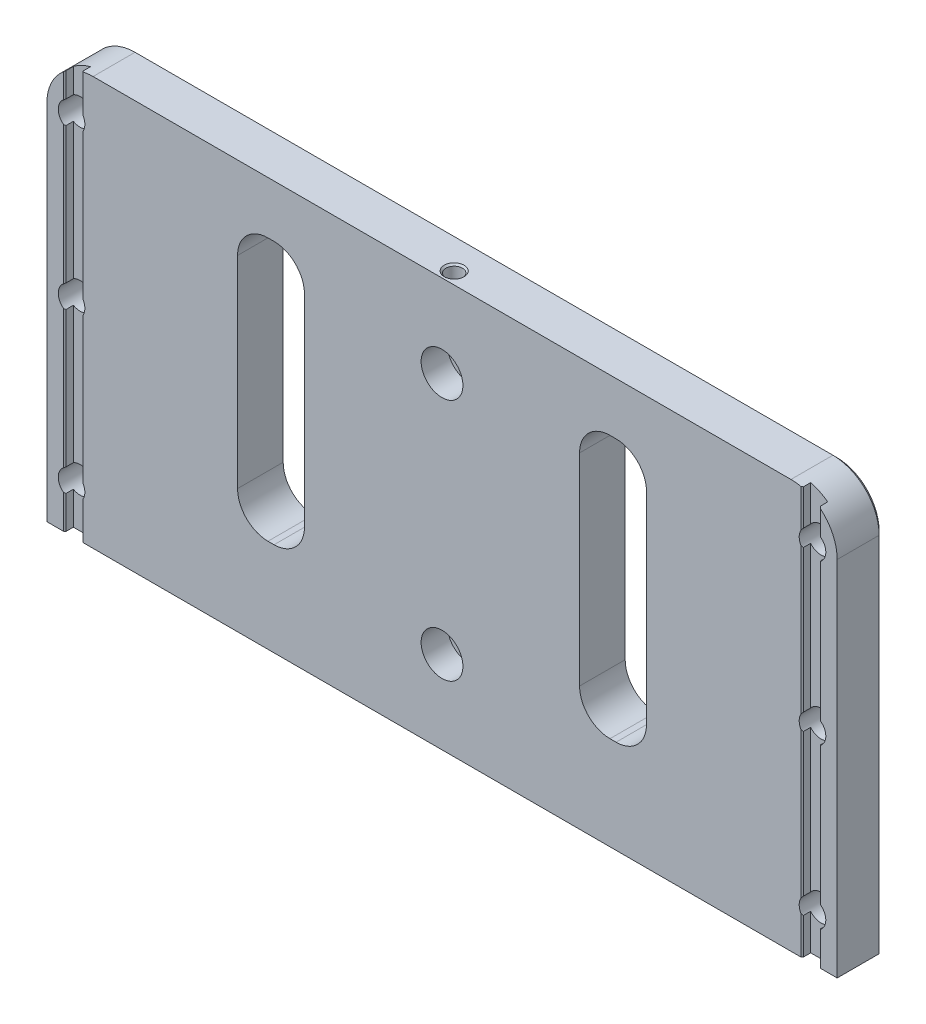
ISO-10303-21;
HEADER;
FILE_DESCRIPTION(('STEP AP214'),'2;1');
FILE_NAME('part.step','',(''),(''),'','','');
FILE_SCHEMA(('AUTOMOTIVE_DESIGN { 1 0 10303 214 1 1 1 1 }'));
ENDSEC;
DATA;
#1=APPLICATION_CONTEXT('core data for automotive mechanical design processes');
#2=APPLICATION_PROTOCOL_DEFINITION('international standard','automotive_design',2000,#1);
#3=PRODUCT_CONTEXT('',#1,'mechanical');
#4=PRODUCT('Part','Part','',(#3));
#5=PRODUCT_RELATED_PRODUCT_CATEGORY('part','',(#4));
#6=PRODUCT_DEFINITION_FORMATION('','',#4);
#7=PRODUCT_DEFINITION_CONTEXT('part definition',#1,'design');
#8=PRODUCT_DEFINITION('design','',#6,#7);
#9=PRODUCT_DEFINITION_SHAPE('','',#8);
#10=(LENGTH_UNIT() NAMED_UNIT(*) SI_UNIT(.MILLI.,.METRE.));
#11=(NAMED_UNIT(*) PLANE_ANGLE_UNIT() SI_UNIT($,.RADIAN.));
#12=(NAMED_UNIT(*) SI_UNIT($,.STERADIAN.) SOLID_ANGLE_UNIT());
#13=UNCERTAINTY_MEASURE_WITH_UNIT(LENGTH_MEASURE(1.E-05),#10,'distance_accuracy_value','');
#14=(GEOMETRIC_REPRESENTATION_CONTEXT(3) GLOBAL_UNCERTAINTY_ASSIGNED_CONTEXT((#13)) GLOBAL_UNIT_ASSIGNED_CONTEXT((#10,
#11,#12)) REPRESENTATION_CONTEXT('',''));
#15=CARTESIAN_POINT('',(0.,0.,0.));
#16=DIRECTION('',(0.,0.,1.));
#17=DIRECTION('',(1.,0.,0.));
#18=AXIS2_PLACEMENT_3D('',#15,#16,#17);
#19=CARTESIAN_POINT('',(78.7654,85.598,-16.256));
#20=DIRECTION('',(0.,-1.,0.));
#21=DIRECTION('',(1.,0.,0.));
#22=AXIS2_PLACEMENT_3D('',#19,#20,#21);
#23=PLANE('',#22);
#24=DIRECTION('',(0.,0.,1.));
#25=VECTOR('',#24,1.);
#26=CARTESIAN_POINT('',(72.8726,85.598,-25.781));
#27=LINE('',#26,#25);
#28=CARTESIAN_POINT('',(72.8726,85.598,-16.256));
#29=VERTEX_POINT('',#28);
#30=CARTESIAN_POINT('',(72.8726,85.598,-25.019));
#31=VERTEX_POINT('',#30);
#32=EDGE_CURVE('E860',#29,#31,#27,.F.);
#33=ORIENTED_EDGE('',*,*,#32,.T.);
#34=DIRECTION('',(-1.,0.,0.));
#35=VECTOR('',#34,1.);
#36=CARTESIAN_POINT('',(-72.8726,85.598,-25.019));
#37=LINE('',#36,#35);
#38=CARTESIAN_POINT('',(-72.8726,85.598,-25.019));
#39=VERTEX_POINT('',#38);
#40=EDGE_CURVE('E971',#31,#39,#37,.T.);
#41=ORIENTED_EDGE('',*,*,#40,.T.);
#42=DIRECTION('',(0.,0.,1.));
#43=VECTOR('',#42,1.);
#44=CARTESIAN_POINT('',(-72.8726,85.598,-16.256));
#45=LINE('',#44,#43);
#46=CARTESIAN_POINT('',(-72.8726,85.598,-16.256));
#47=VERTEX_POINT('',#46);
#48=EDGE_CURVE('E858',#39,#47,#45,.T.);
#49=ORIENTED_EDGE('',*,*,#48,.T.);
#50=DIRECTION('',(-1.,0.,0.));
#51=VECTOR('',#50,1.);
#52=CARTESIAN_POINT('',(73.8378,85.598,-16.256));
#53=LINE('',#52,#51);
#54=EDGE_CURVE('E657',#29,#47,#53,.T.);
#55=ORIENTED_EDGE('',*,*,#54,.F.);
#56=EDGE_LOOP('',(#33,#41,#49,#55));
#57=FACE_BOUND('',#56,.T.);
#58=DIRECTION('',(0.999999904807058,0.,0.000436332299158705));
#59=VECTOR('',#58,1.);
#60=CARTESIAN_POINT('',(2.08279980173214,85.598,-18.7950912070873));
#61=LINE('',#60,#59);
#62=CARTESIAN_POINT('',(2.08305380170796,85.598,-18.7950910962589));
#63=VERTEX_POINT('',#62);
#64=CARTESIAN_POINT('',(2.08279980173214,85.598,-18.7950912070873));
#65=VERTEX_POINT('',#64);
#66=EDGE_CURVE('E1117',#63,#65,#61,.F.);
#67=ORIENTED_EDGE('',*,*,#66,.F.);
#68=CARTESIAN_POINT('',(0.,85.598,-18.796));
#69=DIRECTION('',(0.,1.,0.));
#70=DIRECTION('',(0.,0.,1.));
#71=AXIS2_PLACEMENT_3D('',#68,#69,#70);
#72=CIRCLE('',#71,2.083054);
#73=CARTESIAN_POINT('',(2.083054,85.598,-18.796));
#74=VERTEX_POINT('',#73);
#75=EDGE_CURVE('E1148',#74,#63,#72,.T.);
#76=ORIENTED_EDGE('',*,*,#75,.F.);
#77=DIRECTION('',(1.,0.,0.));
#78=VECTOR('',#77,1.);
#79=CARTESIAN_POINT('',(2.0828,85.598,-18.796));
#80=LINE('',#79,#78);
#81=CARTESIAN_POINT('',(2.0828,85.598,-18.796));
#82=VERTEX_POINT('',#81);
#83=EDGE_CURVE('E19',#74,#82,#80,.F.);
#84=ORIENTED_EDGE('',*,*,#83,.T.);
#85=CARTESIAN_POINT('',(0.,85.598,-18.796));
#86=DIRECTION('',(0.,-1.,0.));
#87=DIRECTION('',(1.,0.,0.));
#88=AXIS2_PLACEMENT_3D('',#85,#86,#87);
#89=CIRCLE('',#88,2.0828);
#90=EDGE_CURVE('E25',#82,#65,#89,.T.);
#91=ORIENTED_EDGE('',*,*,#90,.T.);
#92=EDGE_LOOP('',(#67,#76,#84,#91));
#93=FACE_BOUND('',#92,.T.);
#94=ADVANCED_FACE('F15',(#57,#93),#23,.F.);
#95=CARTESIAN_POINT('',(73.8378,85.598,-16.256));
#96=DIRECTION('',(0.,0.,1.));
#97=DIRECTION('',(1.,0.,0.));
#98=AXIS2_PLACEMENT_3D('',#95,#96,#97);
#99=PLANE('',#98);
#100=CARTESIAN_POINT('',(-72.8726,75.946,-16.256));
#101=DIRECTION('',(0.,0.,1.));
#102=DIRECTION('',(1.,0.,0.));
#103=AXIS2_PLACEMENT_3D('',#100,#101,#102);
#104=CIRCLE('',#103,9.652);
#105=CARTESIAN_POINT('',(-74.9554,85.3705980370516,-16.256));
#106=VERTEX_POINT('',#105);
#107=EDGE_CURVE('E853',#47,#106,#104,.T.);
#108=ORIENTED_EDGE('',*,*,#107,.T.);
#109=DIRECTION('',(0.,-1.,0.));
#110=VECTOR('',#109,1.);
#111=CARTESIAN_POINT('',(-74.9554,85.598,-16.256));
#112=LINE('',#111,#110);
#113=CARTESIAN_POINT('',(-74.9554,77.4497387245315,-16.256));
#114=VERTEX_POINT('',#113);
#115=EDGE_CURVE('E990',#106,#114,#112,.T.);
#116=ORIENTED_EDGE('',*,*,#115,.T.);
#117=CARTESIAN_POINT('',(-77.3684,76.073,-16.256));
#118=DIRECTION('',(0.,0.,1.));
#119=DIRECTION('',(1.,0.,0.));
#120=AXIS2_PLACEMENT_3D('',#117,#118,#119);
#121=CIRCLE('',#120,2.778125);
#122=CARTESIAN_POINT('',(-74.9554,74.6962612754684,-16.256));
#123=VERTEX_POINT('',#122);
#124=EDGE_CURVE('E688',#123,#114,#121,.T.);
#125=ORIENTED_EDGE('',*,*,#124,.F.);
#126=DIRECTION('',(0.,-1.,0.));
#127=VECTOR('',#126,1.);
#128=CARTESIAN_POINT('',(-74.9554,85.598,-16.256));
#129=LINE('',#128,#127);
#130=CARTESIAN_POINT('',(-74.9554,44.1757387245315,-16.256));
#131=VERTEX_POINT('',#130);
#132=EDGE_CURVE('E987',#123,#131,#129,.T.);
#133=ORIENTED_EDGE('',*,*,#132,.T.);
#134=CARTESIAN_POINT('',(-77.3684,42.799,-16.256));
#135=DIRECTION('',(0.,0.,1.));
#136=DIRECTION('',(1.,0.,0.));
#137=AXIS2_PLACEMENT_3D('',#134,#135,#136);
#138=CIRCLE('',#137,2.778125);
#139=CARTESIAN_POINT('',(-74.9554,41.4222612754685,-16.256));
#140=VERTEX_POINT('',#139);
#141=EDGE_CURVE('E751',#140,#131,#138,.T.);
#142=ORIENTED_EDGE('',*,*,#141,.F.);
#143=DIRECTION('',(0.,-1.,0.));
#144=VECTOR('',#143,1.);
#145=CARTESIAN_POINT('',(-74.9554,85.598,-16.256));
#146=LINE('',#145,#144);
#147=CARTESIAN_POINT('',(-74.9554,10.9017387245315,-16.256));
#148=VERTEX_POINT('',#147);
#149=EDGE_CURVE('E984',#140,#148,#146,.T.);
#150=ORIENTED_EDGE('',*,*,#149,.T.);
#151=CARTESIAN_POINT('',(-77.3684,9.525,-16.256));
#152=DIRECTION('',(0.,0.,1.));
#153=DIRECTION('',(1.,0.,0.));
#154=AXIS2_PLACEMENT_3D('',#151,#152,#153);
#155=CIRCLE('',#154,2.778125);
#156=CARTESIAN_POINT('',(-74.9554,8.14826127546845,-16.256));
#157=VERTEX_POINT('',#156);
#158=EDGE_CURVE('E724',#157,#148,#155,.T.);
#159=ORIENTED_EDGE('',*,*,#158,.F.);
#160=DIRECTION('',(0.,-1.,0.));
#161=VECTOR('',#160,1.);
#162=CARTESIAN_POINT('',(-74.9554,85.598,-16.256));
#163=LINE('',#162,#161);
#164=CARTESIAN_POINT('',(-74.9554,0.254000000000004,-16.256));
#165=VERTEX_POINT('',#164);
#166=EDGE_CURVE('E981',#157,#165,#163,.T.);
#167=ORIENTED_EDGE('',*,*,#166,.T.);
#168=DIRECTION('',(-1.,0.,0.));
#169=VECTOR('',#168,1.);
#170=CARTESIAN_POINT('',(73.8378,0.254000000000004,-16.256));
#171=LINE('',#170,#169);
#172=CARTESIAN_POINT('',(74.9554,0.254000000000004,-16.256));
#173=VERTEX_POINT('',#172);
#174=EDGE_CURVE('E622',#173,#165,#171,.T.);
#175=ORIENTED_EDGE('',*,*,#174,.F.);
#176=DIRECTION('',(0.,1.,0.));
#177=VECTOR('',#176,1.);
#178=CARTESIAN_POINT('',(74.9554,7.7766586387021,-16.256));
#179=LINE('',#178,#177);
#180=CARTESIAN_POINT('',(74.9554,8.14826127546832,-16.256));
#181=VERTEX_POINT('',#180);
#182=EDGE_CURVE('E979',#173,#181,#179,.T.);
#183=ORIENTED_EDGE('',*,*,#182,.T.);
#184=CARTESIAN_POINT('',(77.3684,9.525,-16.256));
#185=DIRECTION('',(0.,0.,1.));
#186=DIRECTION('',(1.,0.,0.));
#187=AXIS2_PLACEMENT_3D('',#184,#185,#186);
#188=CIRCLE('',#187,2.778125);
#189=CARTESIAN_POINT('',(74.9554,10.9017387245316,-16.256));
#190=VERTEX_POINT('',#189);
#191=EDGE_CURVE('E721',#190,#181,#188,.T.);
#192=ORIENTED_EDGE('',*,*,#191,.F.);
#193=DIRECTION('',(0.,1.,0.));
#194=VECTOR('',#193,1.);
#195=CARTESIAN_POINT('',(74.9554,41.0506586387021,-16.256));
#196=LINE('',#195,#194);
#197=CARTESIAN_POINT('',(74.9554,41.4222612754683,-16.256));
#198=VERTEX_POINT('',#197);
#199=EDGE_CURVE('E977',#190,#198,#196,.T.);
#200=ORIENTED_EDGE('',*,*,#199,.T.);
#201=CARTESIAN_POINT('',(77.3684,42.799,-16.256));
#202=DIRECTION('',(0.,0.,1.));
#203=DIRECTION('',(1.,0.,0.));
#204=AXIS2_PLACEMENT_3D('',#201,#202,#203);
#205=CIRCLE('',#204,2.778125);
#206=CARTESIAN_POINT('',(74.9554,44.1757387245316,-16.256));
#207=VERTEX_POINT('',#206);
#208=EDGE_CURVE('E699',#207,#198,#205,.T.);
#209=ORIENTED_EDGE('',*,*,#208,.F.);
#210=DIRECTION('',(0.,1.,0.));
#211=VECTOR('',#210,1.);
#212=CARTESIAN_POINT('',(74.9554,74.3246586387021,-16.256));
#213=LINE('',#212,#211);
#214=CARTESIAN_POINT('',(74.9554,74.6962612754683,-16.256));
#215=VERTEX_POINT('',#214);
#216=EDGE_CURVE('E975',#207,#215,#213,.T.);
#217=ORIENTED_EDGE('',*,*,#216,.T.);
#218=CARTESIAN_POINT('',(77.3684,76.073,-16.256));
#219=DIRECTION('',(0.,0.,1.));
#220=DIRECTION('',(1.,0.,0.));
#221=AXIS2_PLACEMENT_3D('',#218,#219,#220);
#222=CIRCLE('',#221,2.778125);
#223=CARTESIAN_POINT('',(74.9554,77.4497387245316,-16.256));
#224=VERTEX_POINT('',#223);
#225=EDGE_CURVE('E692',#224,#215,#222,.T.);
#226=ORIENTED_EDGE('',*,*,#225,.F.);
#227=DIRECTION('',(0.,1.,0.));
#228=VECTOR('',#227,1.);
#229=CARTESIAN_POINT('',(74.9554,85.3108528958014,-16.256));
#230=LINE('',#229,#228);
#231=CARTESIAN_POINT('',(74.9554,85.3705980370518,-16.256));
#232=VERTEX_POINT('',#231);
#233=EDGE_CURVE('E973',#224,#232,#230,.T.);
#234=ORIENTED_EDGE('',*,*,#233,.T.);
#235=CARTESIAN_POINT('',(72.8726,75.946,-16.256));
#236=DIRECTION('',(0.,0.,1.));
#237=DIRECTION('',(1.,0.,0.));
#238=AXIS2_PLACEMENT_3D('',#235,#236,#237);
#239=CIRCLE('',#238,9.652);
#240=EDGE_CURVE('E856',#232,#29,#239,.T.);
#241=ORIENTED_EDGE('',*,*,#240,.T.);
#242=ORIENTED_EDGE('',*,*,#54,.T.);
#243=EDGE_LOOP('',(#108,#116,#125,#133,#142,#150,#159,#167,#175,#183,#192,#200,#209,#217,#226,
#234,#241,#242));
#244=FACE_BOUND('',#243,.T.);
#245=CARTESIAN_POINT('',(0.,68.326,-16.256));
#246=DIRECTION('',(0.,0.,-1.));
#247=DIRECTION('',(-1.,0.,0.));
#248=AXIS2_PLACEMENT_3D('',#245,#246,#247);
#249=CIRCLE('',#248,4.365625);
#250=CARTESIAN_POINT('',(-4.365625,68.326,-16.256));
#251=VERTEX_POINT('',#250);
#252=EDGE_CURVE('E600',#251,#251,#249,.T.);
#253=ORIENTED_EDGE('',*,*,#252,.T.);
#254=EDGE_LOOP('',(#253));
#255=FACE_BOUND('',#254,.T.);
#256=CARTESIAN_POINT('',(0.,17.526,-16.256));
#257=DIRECTION('',(0.,0.,-1.));
#258=DIRECTION('',(-1.,0.,0.));
#259=AXIS2_PLACEMENT_3D('',#256,#257,#258);
#260=CIRCLE('',#259,4.365625);
#261=CARTESIAN_POINT('',(-4.36562499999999,17.526,-16.256));
#262=VERTEX_POINT('',#261);
#263=EDGE_CURVE('E589',#262,#262,#260,.T.);
#264=ORIENTED_EDGE('',*,*,#263,.T.);
#265=EDGE_LOOP('',(#264));
#266=FACE_BOUND('',#265,.T.);
#267=DIRECTION('',(0.,-1.,0.));
#268=VECTOR('',#267,1.);
#269=CARTESIAN_POINT('',(-42.6974,74.676,-16.256));
#270=LINE('',#269,#268);
#271=CARTESIAN_POINT('',(-42.6974,68.326,-16.256));
#272=VERTEX_POINT('',#271);
#273=CARTESIAN_POINT('',(-42.6974,26.162,-16.256));
#274=VERTEX_POINT('',#273);
#275=EDGE_CURVE('E577',#272,#274,#270,.T.);
#276=ORIENTED_EDGE('',*,*,#275,.F.);
#277=CARTESIAN_POINT('',(-36.3474,68.326,-16.256));
#278=DIRECTION('',(0.,0.,1.));
#279=DIRECTION('',(1.,0.,0.));
#280=AXIS2_PLACEMENT_3D('',#277,#278,#279);
#281=CIRCLE('',#280,6.35);
#282=CARTESIAN_POINT('',(-36.3474,74.676,-16.256));
#283=VERTEX_POINT('',#282);
#284=EDGE_CURVE('E923',#272,#283,#281,.F.);
#285=ORIENTED_EDGE('',*,*,#284,.T.);
#286=DIRECTION('',(-1.,0.,0.));
#287=VECTOR('',#286,1.);
#288=CARTESIAN_POINT('',(-28.7274,74.676,-16.256));
#289=LINE('',#288,#287);
#290=CARTESIAN_POINT('',(-35.0774,74.676,-16.256));
#291=VERTEX_POINT('',#290);
#292=EDGE_CURVE('E586',#291,#283,#289,.T.);
#293=ORIENTED_EDGE('',*,*,#292,.F.);
#294=CARTESIAN_POINT('',(-35.0774,68.326,-16.256));
#295=DIRECTION('',(0.,0.,1.));
#296=DIRECTION('',(1.,0.,0.));
#297=AXIS2_PLACEMENT_3D('',#294,#295,#296);
#298=CIRCLE('',#297,6.35);
#299=CARTESIAN_POINT('',(-28.7274,68.326,-16.256));
#300=VERTEX_POINT('',#299);
#301=EDGE_CURVE('E927',#291,#300,#298,.F.);
#302=ORIENTED_EDGE('',*,*,#301,.T.);
#303=DIRECTION('',(0.,1.,0.));
#304=VECTOR('',#303,1.);
#305=CARTESIAN_POINT('',(-28.7274,19.812,-16.256));
#306=LINE('',#305,#304);
#307=CARTESIAN_POINT('',(-28.7274,26.162,-16.256));
#308=VERTEX_POINT('',#307);
#309=EDGE_CURVE('E583',#308,#300,#306,.T.);
#310=ORIENTED_EDGE('',*,*,#309,.F.);
#311=CARTESIAN_POINT('',(-35.0774,26.162,-16.256));
#312=DIRECTION('',(0.,0.,1.));
#313=DIRECTION('',(1.,0.,0.));
#314=AXIS2_PLACEMENT_3D('',#311,#312,#313);
#315=CIRCLE('',#314,6.35);
#316=CARTESIAN_POINT('',(-35.0774,19.812,-16.256));
#317=VERTEX_POINT('',#316);
#318=EDGE_CURVE('E915',#308,#317,#315,.F.);
#319=ORIENTED_EDGE('',*,*,#318,.T.);
#320=DIRECTION('',(1.,0.,0.));
#321=VECTOR('',#320,1.);
#322=CARTESIAN_POINT('',(-42.6974,19.812,-16.256));
#323=LINE('',#322,#321);
#324=CARTESIAN_POINT('',(-36.3474,19.812,-16.256));
#325=VERTEX_POINT('',#324);
#326=EDGE_CURVE('E580',#325,#317,#323,.T.);
#327=ORIENTED_EDGE('',*,*,#326,.F.);
#328=CARTESIAN_POINT('',(-36.3474,26.162,-16.256));
#329=DIRECTION('',(0.,0.,1.));
#330=DIRECTION('',(1.,0.,0.));
#331=AXIS2_PLACEMENT_3D('',#328,#329,#330);
#332=CIRCLE('',#331,6.35);
#333=EDGE_CURVE('E919',#325,#274,#332,.F.);
#334=ORIENTED_EDGE('',*,*,#333,.T.);
#335=EDGE_LOOP('',(#276,#285,#293,#302,#310,#319,#327,#334));
#336=FACE_BOUND('',#335,.T.);
#337=DIRECTION('',(0.,1.,0.));
#338=VECTOR('',#337,1.);
#339=CARTESIAN_POINT('',(28.7274,19.812,-16.256));
#340=LINE('',#339,#338);
#341=CARTESIAN_POINT('',(28.7274,26.162,-16.256));
#342=VERTEX_POINT('',#341);
#343=CARTESIAN_POINT('',(28.7274,68.326,-16.256));
#344=VERTEX_POINT('',#343);
#345=EDGE_CURVE('E571',#342,#344,#340,.T.);
#346=ORIENTED_EDGE('',*,*,#345,.T.);
#347=CARTESIAN_POINT('',(35.0774,68.326,-16.256));
#348=DIRECTION('',(0.,0.,1.));
#349=DIRECTION('',(1.,0.,0.));
#350=AXIS2_PLACEMENT_3D('',#347,#348,#349);
#351=CIRCLE('',#350,6.35);
#352=CARTESIAN_POINT('',(35.0774,74.676,-16.256));
#353=VERTEX_POINT('',#352);
#354=EDGE_CURVE('E943',#344,#353,#351,.F.);
#355=ORIENTED_EDGE('',*,*,#354,.T.);
#356=DIRECTION('',(1.,0.,0.));
#357=VECTOR('',#356,1.);
#358=CARTESIAN_POINT('',(28.7274,74.676,-16.256));
#359=LINE('',#358,#357);
#360=CARTESIAN_POINT('',(36.3474,74.676,-16.256));
#361=VERTEX_POINT('',#360);
#362=EDGE_CURVE('E574',#353,#361,#359,.T.);
#363=ORIENTED_EDGE('',*,*,#362,.T.);
#364=CARTESIAN_POINT('',(36.3474,68.326,-16.256));
#365=DIRECTION('',(0.,0.,1.));
#366=DIRECTION('',(1.,0.,0.));
#367=AXIS2_PLACEMENT_3D('',#364,#365,#366);
#368=CIRCLE('',#367,6.35);
#369=CARTESIAN_POINT('',(42.6974,68.326,-16.256));
#370=VERTEX_POINT('',#369);
#371=EDGE_CURVE('E939',#361,#370,#368,.F.);
#372=ORIENTED_EDGE('',*,*,#371,.T.);
#373=DIRECTION('',(0.,-1.,0.));
#374=VECTOR('',#373,1.);
#375=CARTESIAN_POINT('',(42.6974,74.676,-16.256));
#376=LINE('',#375,#374);
#377=CARTESIAN_POINT('',(42.6974,26.162,-16.256));
#378=VERTEX_POINT('',#377);
#379=EDGE_CURVE('E565',#370,#378,#376,.T.);
#380=ORIENTED_EDGE('',*,*,#379,.T.);
#381=CARTESIAN_POINT('',(36.3474,26.162,-16.256));
#382=DIRECTION('',(0.,0.,1.));
#383=DIRECTION('',(1.,0.,0.));
#384=AXIS2_PLACEMENT_3D('',#381,#382,#383);
#385=CIRCLE('',#384,6.35);
#386=CARTESIAN_POINT('',(36.3474,19.812,-16.256));
#387=VERTEX_POINT('',#386);
#388=EDGE_CURVE('E935',#378,#387,#385,.F.);
#389=ORIENTED_EDGE('',*,*,#388,.T.);
#390=DIRECTION('',(-1.,0.,0.));
#391=VECTOR('',#390,1.);
#392=CARTESIAN_POINT('',(42.6974,19.812,-16.256));
#393=LINE('',#392,#391);
#394=CARTESIAN_POINT('',(35.0774,19.812,-16.256));
#395=VERTEX_POINT('',#394);
#396=EDGE_CURVE('E568',#387,#395,#393,.T.);
#397=ORIENTED_EDGE('',*,*,#396,.T.);
#398=CARTESIAN_POINT('',(35.0774,26.162,-16.256));
#399=DIRECTION('',(0.,0.,1.));
#400=DIRECTION('',(1.,0.,0.));
#401=AXIS2_PLACEMENT_3D('',#398,#399,#400);
#402=CIRCLE('',#401,6.35);
#403=EDGE_CURVE('E931',#395,#342,#402,.F.);
#404=ORIENTED_EDGE('',*,*,#403,.T.);
#405=EDGE_LOOP('',(#346,#355,#363,#372,#380,#389,#397,#404));
#406=FACE_BOUND('',#405,.T.);
#407=ADVANCED_FACE('F1184',(#244,#255,#266,#336,#406),#99,.T.);
#408=CARTESIAN_POINT('',(-82.5246,85.598,-25.781));
#409=DIRECTION('',(0.,0.,-1.));
#410=DIRECTION('',(-1.,0.,0.));
#411=AXIS2_PLACEMENT_3D('',#408,#409,#410);
#412=PLANE('',#411);
#413=DIRECTION('',(1.,0.,0.));
#414=VECTOR('',#413,1.);
#415=CARTESIAN_POINT('',(72.8726,84.836,-25.781));
#416=LINE('',#415,#414);
#417=CARTESIAN_POINT('',(-72.8726,84.836,-25.781));
#418=VERTEX_POINT('',#417);
#419=CARTESIAN_POINT('',(72.8726,84.836,-25.781));
#420=VERTEX_POINT('',#419);
#421=EDGE_CURVE('E947',#418,#420,#416,.T.);
#422=ORIENTED_EDGE('',*,*,#421,.T.);
#423=CARTESIAN_POINT('',(72.8726,75.946,-25.781));
#424=DIRECTION('',(0.,0.,-1.));
#425=DIRECTION('',(-1.,0.,0.));
#426=AXIS2_PLACEMENT_3D('',#423,#424,#425);
#427=CIRCLE('',#426,8.89);
#428=CARTESIAN_POINT('',(81.7626,75.946,-25.781));
#429=VERTEX_POINT('',#428);
#430=EDGE_CURVE('E957',#420,#429,#427,.T.);
#431=ORIENTED_EDGE('',*,*,#430,.T.);
#432=DIRECTION('',(0.,-1.,0.));
#433=VECTOR('',#432,1.);
#434=CARTESIAN_POINT('',(81.7626,85.598,-25.781));
#435=LINE('',#434,#433);
#436=CARTESIAN_POINT('',(81.7626,1.016,-25.781));
#437=VERTEX_POINT('',#436);
#438=EDGE_CURVE('E955',#429,#437,#435,.T.);
#439=ORIENTED_EDGE('',*,*,#438,.T.);
#440=DIRECTION('',(-1.,0.,0.));
#441=VECTOR('',#440,1.);
#442=CARTESIAN_POINT('',(-82.5246,1.016,-25.781));
#443=LINE('',#442,#441);
#444=CARTESIAN_POINT('',(-81.7626,1.016,-25.781));
#445=VERTEX_POINT('',#444);
#446=EDGE_CURVE('E953',#437,#445,#443,.T.);
#447=ORIENTED_EDGE('',*,*,#446,.T.);
#448=DIRECTION('',(0.,1.,0.));
#449=VECTOR('',#448,1.);
#450=CARTESIAN_POINT('',(-81.7626,75.946,-25.781));
#451=LINE('',#450,#449);
#452=CARTESIAN_POINT('',(-81.7626,75.946,-25.781));
#453=VERTEX_POINT('',#452);
#454=EDGE_CURVE('E951',#445,#453,#451,.T.);
#455=ORIENTED_EDGE('',*,*,#454,.T.);
#456=CARTESIAN_POINT('',(-72.8726,75.946,-25.781));
#457=DIRECTION('',(0.,0.,-1.));
#458=DIRECTION('',(-1.,0.,0.));
#459=AXIS2_PLACEMENT_3D('',#456,#457,#458);
#460=CIRCLE('',#459,8.89);
#461=EDGE_CURVE('E949',#453,#418,#460,.T.);
#462=ORIENTED_EDGE('',*,*,#461,.T.);
#463=EDGE_LOOP('',(#422,#431,#439,#447,#455,#462));
#464=FACE_BOUND('',#463,.T.);
#465=DIRECTION('',(0.,-1.,0.));
#466=VECTOR('',#465,1.);
#467=CARTESIAN_POINT('',(42.6974,85.598,-25.781));
#468=LINE('',#467,#466);
#469=CARTESIAN_POINT('',(42.6974,68.326,-25.781));
#470=VERTEX_POINT('',#469);
#471=CARTESIAN_POINT('',(42.6974,26.162,-25.781));
#472=VERTEX_POINT('',#471);
#473=EDGE_CURVE('E839',#470,#472,#468,.T.);
#474=ORIENTED_EDGE('',*,*,#473,.F.);
#475=CARTESIAN_POINT('',(36.3474,68.326,-25.781));
#476=DIRECTION('',(0.,0.,-1.));
#477=DIRECTION('',(-1.,0.,0.));
#478=AXIS2_PLACEMENT_3D('',#475,#476,#477);
#479=CIRCLE('',#478,6.35);
#480=CARTESIAN_POINT('',(36.3474,74.676,-25.781));
#481=VERTEX_POINT('',#480);
#482=EDGE_CURVE('E941',#470,#481,#479,.F.);
#483=ORIENTED_EDGE('',*,*,#482,.T.);
#484=DIRECTION('',(1.,0.,0.));
#485=VECTOR('',#484,1.);
#486=CARTESIAN_POINT('',(-82.5246,74.676,-25.781));
#487=LINE('',#486,#485);
#488=CARTESIAN_POINT('',(35.0774,74.676,-25.781));
#489=VERTEX_POINT('',#488);
#490=EDGE_CURVE('E830',#489,#481,#487,.T.);
#491=ORIENTED_EDGE('',*,*,#490,.F.);
#492=CARTESIAN_POINT('',(35.0774,68.326,-25.781));
#493=DIRECTION('',(0.,0.,-1.));
#494=DIRECTION('',(-1.,0.,0.));
#495=AXIS2_PLACEMENT_3D('',#492,#493,#494);
#496=CIRCLE('',#495,6.35);
#497=CARTESIAN_POINT('',(28.7274,68.326,-25.781));
#498=VERTEX_POINT('',#497);
#499=EDGE_CURVE('E945',#489,#498,#496,.F.);
#500=ORIENTED_EDGE('',*,*,#499,.T.);
#501=DIRECTION('',(0.,1.,0.));
#502=VECTOR('',#501,1.);
#503=CARTESIAN_POINT('',(28.7274,85.598,-25.781));
#504=LINE('',#503,#502);
#505=CARTESIAN_POINT('',(28.7274,26.162,-25.781));
#506=VERTEX_POINT('',#505);
#507=EDGE_CURVE('E833',#506,#498,#504,.T.);
#508=ORIENTED_EDGE('',*,*,#507,.F.);
#509=CARTESIAN_POINT('',(35.0774,26.162,-25.781));
#510=DIRECTION('',(0.,0.,-1.));
#511=DIRECTION('',(-1.,0.,0.));
#512=AXIS2_PLACEMENT_3D('',#509,#510,#511);
#513=CIRCLE('',#512,6.35);
#514=CARTESIAN_POINT('',(35.0774,19.812,-25.781));
#515=VERTEX_POINT('',#514);
#516=EDGE_CURVE('E933',#506,#515,#513,.F.);
#517=ORIENTED_EDGE('',*,*,#516,.T.);
#518=DIRECTION('',(-1.,0.,0.));
#519=VECTOR('',#518,1.);
#520=CARTESIAN_POINT('',(-82.5246,19.812,-25.781));
#521=LINE('',#520,#519);
#522=CARTESIAN_POINT('',(36.3474,19.812,-25.781));
#523=VERTEX_POINT('',#522);
#524=EDGE_CURVE('E836',#523,#515,#521,.T.);
#525=ORIENTED_EDGE('',*,*,#524,.F.);
#526=CARTESIAN_POINT('',(36.3474,26.162,-25.781));
#527=DIRECTION('',(0.,0.,-1.));
#528=DIRECTION('',(-1.,0.,0.));
#529=AXIS2_PLACEMENT_3D('',#526,#527,#528);
#530=CIRCLE('',#529,6.35);
#531=EDGE_CURVE('E937',#523,#472,#530,.F.);
#532=ORIENTED_EDGE('',*,*,#531,.T.);
#533=EDGE_LOOP('',(#474,#483,#491,#500,#508,#517,#525,#532));
#534=FACE_BOUND('',#533,.T.);
#535=DIRECTION('',(0.,1.,0.));
#536=VECTOR('',#535,1.);
#537=CARTESIAN_POINT('',(-42.6974,85.598,-25.781));
#538=LINE('',#537,#536);
#539=CARTESIAN_POINT('',(-42.6974,26.162,-25.781));
#540=VERTEX_POINT('',#539);
#541=CARTESIAN_POINT('',(-42.6974,68.326,-25.781));
#542=VERTEX_POINT('',#541);
#543=EDGE_CURVE('E827',#540,#542,#538,.T.);
#544=ORIENTED_EDGE('',*,*,#543,.F.);
#545=CARTESIAN_POINT('',(-36.3474,26.162,-25.781));
#546=DIRECTION('',(0.,0.,-1.));
#547=DIRECTION('',(-1.,0.,0.));
#548=AXIS2_PLACEMENT_3D('',#545,#546,#547);
#549=CIRCLE('',#548,6.35);
#550=CARTESIAN_POINT('',(-36.3474,19.812,-25.781));
#551=VERTEX_POINT('',#550);
#552=EDGE_CURVE('E921',#540,#551,#549,.F.);
#553=ORIENTED_EDGE('',*,*,#552,.T.);
#554=DIRECTION('',(-1.,0.,0.));
#555=VECTOR('',#554,1.);
#556=CARTESIAN_POINT('',(-82.5246,19.812,-25.781));
#557=LINE('',#556,#555);
#558=CARTESIAN_POINT('',(-35.0774,19.812,-25.781));
#559=VERTEX_POINT('',#558);
#560=EDGE_CURVE('E824',#559,#551,#557,.T.);
#561=ORIENTED_EDGE('',*,*,#560,.F.);
#562=CARTESIAN_POINT('',(-35.0774,26.162,-25.781));
#563=DIRECTION('',(0.,0.,-1.));
#564=DIRECTION('',(-1.,0.,0.));
#565=AXIS2_PLACEMENT_3D('',#562,#563,#564);
#566=CIRCLE('',#565,6.35);
#567=CARTESIAN_POINT('',(-28.7274,26.162,-25.781));
#568=VERTEX_POINT('',#567);
#569=EDGE_CURVE('E917',#559,#568,#566,.F.);
#570=ORIENTED_EDGE('',*,*,#569,.T.);
#571=DIRECTION('',(0.,-1.,0.));
#572=VECTOR('',#571,1.);
#573=CARTESIAN_POINT('',(-28.7274,85.598,-25.781));
#574=LINE('',#573,#572);
#575=CARTESIAN_POINT('',(-28.7274,68.326,-25.781));
#576=VERTEX_POINT('',#575);
#577=EDGE_CURVE('E821',#576,#568,#574,.T.);
#578=ORIENTED_EDGE('',*,*,#577,.F.);
#579=CARTESIAN_POINT('',(-35.0774,68.326,-25.781));
#580=DIRECTION('',(0.,0.,-1.));
#581=DIRECTION('',(-1.,0.,0.));
#582=AXIS2_PLACEMENT_3D('',#579,#580,#581);
#583=CIRCLE('',#582,6.35);
#584=CARTESIAN_POINT('',(-35.0774,74.676,-25.781));
#585=VERTEX_POINT('',#584);
#586=EDGE_CURVE('E929',#576,#585,#583,.F.);
#587=ORIENTED_EDGE('',*,*,#586,.T.);
#588=DIRECTION('',(1.,0.,0.));
#589=VECTOR('',#588,1.);
#590=CARTESIAN_POINT('',(-82.5246,74.676,-25.781));
#591=LINE('',#590,#589);
#592=CARTESIAN_POINT('',(-36.3474,74.676,-25.781));
#593=VERTEX_POINT('',#592);
#594=EDGE_CURVE('E671',#593,#585,#591,.T.);
#595=ORIENTED_EDGE('',*,*,#594,.F.);
#596=CARTESIAN_POINT('',(-36.3474,68.326,-25.781));
#597=DIRECTION('',(0.,0.,-1.));
#598=DIRECTION('',(-1.,0.,0.));
#599=AXIS2_PLACEMENT_3D('',#596,#597,#598);
#600=CIRCLE('',#599,6.35);
#601=EDGE_CURVE('E925',#593,#542,#600,.F.);
#602=ORIENTED_EDGE('',*,*,#601,.T.);
#603=EDGE_LOOP('',(#544,#553,#561,#570,#578,#587,#595,#602));
#604=FACE_BOUND('',#603,.T.);
#605=CARTESIAN_POINT('',(0.,68.326,-25.781));
#606=DIRECTION('',(0.,0.,-1.));
#607=DIRECTION('',(-1.,0.,0.));
#608=AXIS2_PLACEMENT_3D('',#605,#606,#607);
#609=CIRCLE('',#608,2.778125);
#610=CARTESIAN_POINT('',(-2.778125,68.326,-25.781));
#611=VERTEX_POINT('',#610);
#612=EDGE_CURVE('E603',#611,#611,#609,.T.);
#613=ORIENTED_EDGE('',*,*,#612,.F.);
#614=EDGE_LOOP('',(#613));
#615=FACE_BOUND('',#614,.T.);
#616=CARTESIAN_POINT('',(0.,17.526,-25.781));
#617=DIRECTION('',(0.,0.,-1.));
#618=DIRECTION('',(-1.,0.,0.));
#619=AXIS2_PLACEMENT_3D('',#616,#617,#618);
#620=CIRCLE('',#619,2.778125);
#621=CARTESIAN_POINT('',(-2.77812499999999,17.526,-25.781));
#622=VERTEX_POINT('',#621);
#623=EDGE_CURVE('E606',#622,#622,#620,.T.);
#624=ORIENTED_EDGE('',*,*,#623,.F.);
#625=EDGE_LOOP('',(#624));
#626=FACE_BOUND('',#625,.T.);
#627=CARTESIAN_POINT('',(-77.3684,76.073,-25.781));
#628=DIRECTION('',(0.,0.,-1.));
#629=DIRECTION('',(-1.,0.,0.));
#630=AXIS2_PLACEMENT_3D('',#627,#628,#629);
#631=CIRCLE('',#630,2.778125);
#632=CARTESIAN_POINT('',(-80.146525,76.073,-25.781));
#633=VERTEX_POINT('',#632);
#634=EDGE_CURVE('E687',#633,#633,#631,.T.);
#635=ORIENTED_EDGE('',*,*,#634,.F.);
#636=EDGE_LOOP('',(#635));
#637=FACE_BOUND('',#636,.T.);
#638=CARTESIAN_POINT('',(77.3684,76.073,-25.781));
#639=DIRECTION('',(0.,0.,-1.));
#640=DIRECTION('',(-1.,0.,0.));
#641=AXIS2_PLACEMENT_3D('',#638,#639,#640);
#642=CIRCLE('',#641,2.778125);
#643=CARTESIAN_POINT('',(74.590275,76.073,-25.781));
#644=VERTEX_POINT('',#643);
#645=EDGE_CURVE('E675',#644,#644,#642,.T.);
#646=ORIENTED_EDGE('',*,*,#645,.F.);
#647=EDGE_LOOP('',(#646));
#648=FACE_BOUND('',#647,.T.);
#649=CARTESIAN_POINT('',(77.3684,9.525,-25.781));
#650=DIRECTION('',(0.,0.,-1.));
#651=DIRECTION('',(-1.,0.,0.));
#652=AXIS2_PLACEMENT_3D('',#649,#650,#651);
#653=CIRCLE('',#652,2.778125);
#654=CARTESIAN_POINT('',(74.590275,9.525,-25.781));
#655=VERTEX_POINT('',#654);
#656=EDGE_CURVE('E700',#655,#655,#653,.T.);
#657=ORIENTED_EDGE('',*,*,#656,.F.);
#658=EDGE_LOOP('',(#657));
#659=FACE_BOUND('',#658,.T.);
#660=CARTESIAN_POINT('',(-77.3684,9.525,-25.781));
#661=DIRECTION('',(0.,0.,-1.));
#662=DIRECTION('',(-1.,0.,0.));
#663=AXIS2_PLACEMENT_3D('',#660,#661,#662);
#664=CIRCLE('',#663,2.778125);
#665=CARTESIAN_POINT('',(-80.146525,9.525,-25.781));
#666=VERTEX_POINT('',#665);
#667=EDGE_CURVE('E712',#666,#666,#664,.T.);
#668=ORIENTED_EDGE('',*,*,#667,.F.);
#669=EDGE_LOOP('',(#668));
#670=FACE_BOUND('',#669,.T.);
#671=CARTESIAN_POINT('',(77.3684,42.799,-25.781));
#672=DIRECTION('',(0.,0.,-1.));
#673=DIRECTION('',(-1.,0.,0.));
#674=AXIS2_PLACEMENT_3D('',#671,#672,#673);
#675=CIRCLE('',#674,2.778125);
#676=CARTESIAN_POINT('',(74.590275,42.799,-25.781));
#677=VERTEX_POINT('',#676);
#678=EDGE_CURVE('E744',#677,#677,#675,.T.);
#679=ORIENTED_EDGE('',*,*,#678,.F.);
#680=EDGE_LOOP('',(#679));
#681=FACE_BOUND('',#680,.T.);
#682=CARTESIAN_POINT('',(-77.3684,42.799,-25.781));
#683=DIRECTION('',(0.,0.,-1.));
#684=DIRECTION('',(-1.,0.,0.));
#685=AXIS2_PLACEMENT_3D('',#682,#683,#684);
#686=CIRCLE('',#685,2.778125);
#687=CARTESIAN_POINT('',(-80.146525,42.799,-25.781));
#688=VERTEX_POINT('',#687);
#689=EDGE_CURVE('E634',#688,#688,#686,.T.);
#690=ORIENTED_EDGE('',*,*,#689,.F.);
#691=EDGE_LOOP('',(#690));
#692=FACE_BOUND('',#691,.T.);
#693=ADVANCED_FACE('F1190',(#464,#534,#604,#615,#626,#637,#648,#659,#670,#681,#692),#412,.T.);
#694=CARTESIAN_POINT('',(78.7654,85.598,-16.256));
#695=DIRECTION('',(0.,0.,-1.));
#696=DIRECTION('',(-1.,0.,0.));
#697=AXIS2_PLACEMENT_3D('',#694,#695,#696);
#698=PLANE('',#697);
#699=CARTESIAN_POINT('',(77.3684,9.525,-16.256));
#700=DIRECTION('',(0.,0.,-1.));
#701=DIRECTION('',(-1.,0.,0.));
#702=AXIS2_PLACEMENT_3D('',#699,#700,#701);
#703=CIRCLE('',#702,2.778125);
#704=CARTESIAN_POINT('',(79.0194,11.7593181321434,-16.256));
#705=VERTEX_POINT('',#704);
#706=CARTESIAN_POINT('',(79.0194,7.29068186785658,-16.256));
#707=VERTEX_POINT('',#706);
#708=EDGE_CURVE('E708',#705,#707,#703,.T.);
#709=ORIENTED_EDGE('',*,*,#708,.T.);
#710=DIRECTION('',(0.,-1.,0.));
#711=VECTOR('',#710,1.);
#712=CARTESIAN_POINT('',(79.0194,85.598,-16.256));
#713=LINE('',#712,#711);
#714=CARTESIAN_POINT('',(79.0194,0.254000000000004,-16.256));
#715=VERTEX_POINT('',#714);
#716=EDGE_CURVE('E1066',#707,#715,#713,.T.);
#717=ORIENTED_EDGE('',*,*,#716,.T.);
#718=DIRECTION('',(1.,0.,0.));
#719=VECTOR('',#718,1.);
#720=CARTESIAN_POINT('',(78.7654,0.254000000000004,-16.256));
#721=LINE('',#720,#719);
#722=CARTESIAN_POINT('',(82.5246,0.254000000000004,-16.256));
#723=VERTEX_POINT('',#722);
#724=EDGE_CURVE('E625',#715,#723,#721,.T.);
#725=ORIENTED_EDGE('',*,*,#724,.T.);
#726=DIRECTION('',(0.,-1.,0.));
#727=VECTOR('',#726,1.);
#728=CARTESIAN_POINT('',(82.5246,85.598,-16.256));
#729=LINE('',#728,#727);
#730=CARTESIAN_POINT('',(82.5246,75.946,-16.256));
#731=VERTEX_POINT('',#730);
#732=EDGE_CURVE('E609',#731,#723,#729,.T.);
#733=ORIENTED_EDGE('',*,*,#732,.F.);
#734=CARTESIAN_POINT('',(72.8726,75.946,-16.256));
#735=DIRECTION('',(0.,0.,-1.));
#736=DIRECTION('',(-1.,0.,0.));
#737=AXIS2_PLACEMENT_3D('',#734,#735,#736);
#738=CIRCLE('',#737,9.652);
#739=CARTESIAN_POINT('',(79.0194,83.3876364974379,-16.256));
#740=VERTEX_POINT('',#739);
#741=EDGE_CURVE('E844',#731,#740,#738,.F.);
#742=ORIENTED_EDGE('',*,*,#741,.T.);
#743=DIRECTION('',(0.,-1.,0.));
#744=VECTOR('',#743,1.);
#745=CARTESIAN_POINT('',(79.0194,85.598,-16.256));
#746=LINE('',#745,#744);
#747=CARTESIAN_POINT('',(79.0194,78.3073181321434,-16.256));
#748=VERTEX_POINT('',#747);
#749=EDGE_CURVE('E1057',#740,#748,#746,.T.);
#750=ORIENTED_EDGE('',*,*,#749,.T.);
#751=CARTESIAN_POINT('',(77.3684,76.073,-16.256));
#752=DIRECTION('',(0.,0.,-1.));
#753=DIRECTION('',(-1.,0.,0.));
#754=AXIS2_PLACEMENT_3D('',#751,#752,#753);
#755=CIRCLE('',#754,2.778125);
#756=CARTESIAN_POINT('',(79.0194,73.8386818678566,-16.256));
#757=VERTEX_POINT('',#756);
#758=EDGE_CURVE('E704',#748,#757,#755,.T.);
#759=ORIENTED_EDGE('',*,*,#758,.T.);
#760=DIRECTION('',(0.,-1.,0.));
#761=VECTOR('',#760,1.);
#762=CARTESIAN_POINT('',(79.0194,85.598,-16.256));
#763=LINE('',#762,#761);
#764=CARTESIAN_POINT('',(79.0194,45.0333181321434,-16.256));
#765=VERTEX_POINT('',#764);
#766=EDGE_CURVE('E1060',#757,#765,#763,.T.);
#767=ORIENTED_EDGE('',*,*,#766,.T.);
#768=CARTESIAN_POINT('',(77.3684,42.799,-16.256));
#769=DIRECTION('',(0.,0.,-1.));
#770=DIRECTION('',(-1.,0.,0.));
#771=AXIS2_PLACEMENT_3D('',#768,#769,#770);
#772=CIRCLE('',#771,2.778125);
#773=CARTESIAN_POINT('',(79.0194,40.5646818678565,-16.256));
#774=VERTEX_POINT('',#773);
#775=EDGE_CURVE('E691',#765,#774,#772,.T.);
#776=ORIENTED_EDGE('',*,*,#775,.T.);
#777=DIRECTION('',(0.,-1.,0.));
#778=VECTOR('',#777,1.);
#779=CARTESIAN_POINT('',(79.0194,85.598,-16.256));
#780=LINE('',#779,#778);
#781=EDGE_CURVE('E1063',#774,#705,#780,.T.);
#782=ORIENTED_EDGE('',*,*,#781,.T.);
#783=EDGE_LOOP('',(#709,#717,#725,#733,#742,#750,#759,#767,#776,#782));
#784=FACE_BOUND('',#783,.T.);
#785=ADVANCED_FACE('F1218',(#784),#698,.F.);
#786=CARTESIAN_POINT('',(0.,0.254,0.));
#787=DIRECTION('',(0.,1.,0.));
#788=DIRECTION('',(0.,0.,1.));
#789=AXIS2_PLACEMENT_3D('',#786,#787,#788);
#790=PLANE('',#789);
#791=ORIENTED_EDGE('',*,*,#174,.T.);
#792=DIRECTION('',(0.707106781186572,0.,0.707106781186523));
#793=VECTOR('',#792,1.);
#794=CARTESIAN_POINT('',(-74.9554,0.254000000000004,-16.256));
#795=LINE('',#794,#793);
#796=CARTESIAN_POINT('',(-75.2094,0.254000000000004,-16.51));
#797=VERTEX_POINT('',#796);
#798=EDGE_CURVE('E1050',#165,#797,#795,.F.);
#799=ORIENTED_EDGE('',*,*,#798,.T.);
#800=DIRECTION('',(0.,0.,-1.));
#801=VECTOR('',#800,1.);
#802=CARTESIAN_POINT('',(-75.2094,0.254000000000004,-16.256));
#803=LINE('',#802,#801);
#804=CARTESIAN_POINT('',(-75.2094,0.254000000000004,-18.034));
#805=VERTEX_POINT('',#804);
#806=EDGE_CURVE('E620',#797,#805,#803,.T.);
#807=ORIENTED_EDGE('',*,*,#806,.T.);
#808=DIRECTION('',(-1.,0.,0.));
#809=VECTOR('',#808,1.);
#810=CARTESIAN_POINT('',(-75.2094,0.254000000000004,-18.034));
#811=LINE('',#810,#809);
#812=CARTESIAN_POINT('',(-78.7654,0.254000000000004,-18.034));
#813=VERTEX_POINT('',#812);
#814=EDGE_CURVE('E661',#805,#813,#811,.T.);
#815=ORIENTED_EDGE('',*,*,#814,.T.);
#816=DIRECTION('',(0.,0.,1.));
#817=VECTOR('',#816,1.);
#818=CARTESIAN_POINT('',(-78.7654,0.254000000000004,-17.78));
#819=LINE('',#818,#817);
#820=CARTESIAN_POINT('',(-78.7654,0.254000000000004,-16.51));
#821=VERTEX_POINT('',#820);
#822=EDGE_CURVE('E615',#813,#821,#819,.T.);
#823=ORIENTED_EDGE('',*,*,#822,.T.);
#824=DIRECTION('',(0.707106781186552,0.,-0.707106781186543));
#825=VECTOR('',#824,1.);
#826=CARTESIAN_POINT('',(-78.7654,0.254000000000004,-16.51));
#827=LINE('',#826,#825);
#828=CARTESIAN_POINT('',(-79.0194,0.254000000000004,-16.256));
#829=VERTEX_POINT('',#828);
#830=EDGE_CURVE('E1048',#821,#829,#827,.F.);
#831=ORIENTED_EDGE('',*,*,#830,.T.);
#832=DIRECTION('',(-1.,0.,0.));
#833=VECTOR('',#832,1.);
#834=CARTESIAN_POINT('',(-78.7654,0.254000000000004,-16.256));
#835=LINE('',#834,#833);
#836=CARTESIAN_POINT('',(-82.5246,0.254,-16.256));
#837=VERTEX_POINT('',#836);
#838=EDGE_CURVE('E618',#829,#837,#835,.T.);
#839=ORIENTED_EDGE('',*,*,#838,.T.);
#840=DIRECTION('',(0.,0.,-1.));
#841=VECTOR('',#840,1.);
#842=CARTESIAN_POINT('',(-82.5246,0.254,0.));
#843=LINE('',#842,#841);
#844=CARTESIAN_POINT('',(-82.5246,0.254,-25.019));
#845=VERTEX_POINT('',#844);
#846=EDGE_CURVE('E664',#837,#845,#843,.T.);
#847=ORIENTED_EDGE('',*,*,#846,.T.);
#848=DIRECTION('',(1.,0.,0.));
#849=VECTOR('',#848,1.);
#850=CARTESIAN_POINT('',(82.5246,0.254,-25.019));
#851=LINE('',#850,#849);
#852=CARTESIAN_POINT('',(82.5246,0.254,-25.019));
#853=VERTEX_POINT('',#852);
#854=EDGE_CURVE('E965',#845,#853,#851,.T.);
#855=ORIENTED_EDGE('',*,*,#854,.T.);
#856=DIRECTION('',(0.,0.,-1.));
#857=VECTOR('',#856,1.);
#858=CARTESIAN_POINT('',(82.5246,0.254,0.));
#859=LINE('',#858,#857);
#860=EDGE_CURVE('E668',#723,#853,#859,.T.);
#861=ORIENTED_EDGE('',*,*,#860,.F.);
#862=ORIENTED_EDGE('',*,*,#724,.F.);
#863=DIRECTION('',(0.707106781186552,0.,0.707106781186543));
#864=VECTOR('',#863,1.);
#865=CARTESIAN_POINT('',(79.0194,0.254000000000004,-16.256));
#866=LINE('',#865,#864);
#867=CARTESIAN_POINT('',(78.7654,0.254000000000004,-16.51));
#868=VERTEX_POINT('',#867);
#869=EDGE_CURVE('E1046',#715,#868,#866,.F.);
#870=ORIENTED_EDGE('',*,*,#869,.T.);
#871=DIRECTION('',(0.,0.,1.));
#872=VECTOR('',#871,1.);
#873=CARTESIAN_POINT('',(78.7654,0.254000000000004,-17.78));
#874=LINE('',#873,#872);
#875=CARTESIAN_POINT('',(78.7654,0.254000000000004,-18.034));
#876=VERTEX_POINT('',#875);
#877=EDGE_CURVE('E627',#876,#868,#874,.T.);
#878=ORIENTED_EDGE('',*,*,#877,.F.);
#879=DIRECTION('',(1.,0.,0.));
#880=VECTOR('',#879,1.);
#881=CARTESIAN_POINT('',(75.2094,0.254000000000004,-18.034));
#882=LINE('',#881,#880);
#883=CARTESIAN_POINT('',(75.2094,0.254000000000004,-18.034));
#884=VERTEX_POINT('',#883);
#885=EDGE_CURVE('E630',#884,#876,#882,.T.);
#886=ORIENTED_EDGE('',*,*,#885,.F.);
#887=DIRECTION('',(0.,0.,-1.));
#888=VECTOR('',#887,1.);
#889=CARTESIAN_POINT('',(75.2094,0.254000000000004,-16.256));
#890=LINE('',#889,#888);
#891=CARTESIAN_POINT('',(75.2094,0.254000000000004,-16.51));
#892=VERTEX_POINT('',#891);
#893=EDGE_CURVE('E632',#892,#884,#890,.T.);
#894=ORIENTED_EDGE('',*,*,#893,.F.);
#895=DIRECTION('',(-0.707106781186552,0.,0.707106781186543));
#896=VECTOR('',#895,1.);
#897=CARTESIAN_POINT('',(75.2094,0.254000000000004,-16.51));
#898=LINE('',#897,#896);
#899=EDGE_CURVE('E1044',#892,#173,#898,.T.);
#900=ORIENTED_EDGE('',*,*,#899,.T.);
#901=EDGE_LOOP('',(#791,#799,#807,#815,#823,#831,#839,#847,#855,#861,#862,#870,#878,#886,#894,#900));
#902=FACE_BOUND('',#901,.T.);
#903=ADVANCED_FACE('F1194',(#902),#790,.F.);
#904=CARTESIAN_POINT('',(-75.2094,85.598,-16.256));
#905=DIRECTION('',(-1.,0.,0.));
#906=DIRECTION('',(0.,0.,1.));
#907=AXIS2_PLACEMENT_3D('',#904,#905,#906);
#908=PLANE('',#907);
#909=DIRECTION('',(0.,0.,1.));
#910=VECTOR('',#909,1.);
#911=CARTESIAN_POINT('',(-75.2094,11.2733413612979,-17.145));
#912=LINE('',#911,#910);
#913=CARTESIAN_POINT('',(-75.2094,11.2733413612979,-16.51));
#914=VERTEX_POINT('',#913);
#915=CARTESIAN_POINT('',(-75.2094,11.2733413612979,-18.034));
#916=VERTEX_POINT('',#915);
#917=EDGE_CURVE('E784',#914,#916,#912,.F.);
#918=ORIENTED_EDGE('',*,*,#917,.F.);
#919=DIRECTION('',(0.,1.,0.));
#920=VECTOR('',#919,1.);
#921=CARTESIAN_POINT('',(-75.2094,85.598,-16.51));
#922=LINE('',#921,#920);
#923=CARTESIAN_POINT('',(-75.2094,41.0506586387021,-16.51));
#924=VERTEX_POINT('',#923);
#925=EDGE_CURVE('E1039',#914,#924,#922,.T.);
#926=ORIENTED_EDGE('',*,*,#925,.T.);
#927=DIRECTION('',(0.,0.,1.));
#928=VECTOR('',#927,1.);
#929=CARTESIAN_POINT('',(-75.2094,41.0506586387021,-17.145));
#930=LINE('',#929,#928);
#931=CARTESIAN_POINT('',(-75.2094,41.0506586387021,-18.034));
#932=VERTEX_POINT('',#931);
#933=EDGE_CURVE('E797',#932,#924,#930,.T.);
#934=ORIENTED_EDGE('',*,*,#933,.F.);
#935=DIRECTION('',(0.,-1.,0.));
#936=VECTOR('',#935,1.);
#937=CARTESIAN_POINT('',(-75.2094,85.598,-18.034));
#938=LINE('',#937,#936);
#939=EDGE_CURVE('E651',#932,#916,#938,.T.);
#940=ORIENTED_EDGE('',*,*,#939,.T.);
#941=EDGE_LOOP('',(#918,#926,#934,#940));
#942=FACE_BOUND('',#941,.T.);
#943=ADVANCED_FACE('F1203',(#942),#908,.T.);
#944=CARTESIAN_POINT('',(-78.7654,85.598,-17.78));
#945=DIRECTION('',(1.,0.,0.));
#946=DIRECTION('',(0.,0.,-1.));
#947=AXIS2_PLACEMENT_3D('',#944,#945,#946);
#948=PLANE('',#947);
#949=DIRECTION('',(0.,0.,1.));
#950=VECTOR('',#949,1.);
#951=CARTESIAN_POINT('',(-78.7654,73.6716733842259,-17.145));
#952=LINE('',#951,#950);
#953=CARTESIAN_POINT('',(-78.7654,73.6716733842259,-16.51));
#954=VERTEX_POINT('',#953);
#955=CARTESIAN_POINT('',(-78.7654,73.6716733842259,-18.034));
#956=VERTEX_POINT('',#955);
#957=EDGE_CURVE('E679',#954,#956,#952,.F.);
#958=ORIENTED_EDGE('',*,*,#957,.F.);
#959=DIRECTION('',(0.,-1.,0.));
#960=VECTOR('',#959,1.);
#961=CARTESIAN_POINT('',(-78.7654,85.598,-16.51));
#962=LINE('',#961,#960);
#963=CARTESIAN_POINT('',(-78.7654,45.2003266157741,-16.51));
#964=VERTEX_POINT('',#963);
#965=EDGE_CURVE('E1028',#954,#964,#962,.T.);
#966=ORIENTED_EDGE('',*,*,#965,.T.);
#967=DIRECTION('',(0.,0.,1.));
#968=VECTOR('',#967,1.);
#969=CARTESIAN_POINT('',(-78.7654,45.2003266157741,-17.145));
#970=LINE('',#969,#968);
#971=CARTESIAN_POINT('',(-78.7654,45.2003266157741,-18.034));
#972=VERTEX_POINT('',#971);
#973=EDGE_CURVE('E804',#972,#964,#970,.T.);
#974=ORIENTED_EDGE('',*,*,#973,.F.);
#975=DIRECTION('',(0.,-1.,0.));
#976=VECTOR('',#975,1.);
#977=CARTESIAN_POINT('',(-78.7654,85.598,-18.034));
#978=LINE('',#977,#976);
#979=EDGE_CURVE('E648',#956,#972,#978,.T.);
#980=ORIENTED_EDGE('',*,*,#979,.F.);
#981=EDGE_LOOP('',(#958,#966,#974,#980));
#982=FACE_BOUND('',#981,.T.);
#983=ADVANCED_FACE('F1210',(#982),#948,.T.);
#984=CARTESIAN_POINT('',(-75.2094,85.598,-18.034));
#985=DIRECTION('',(0.,0.,1.));
#986=DIRECTION('',(1.,0.,0.));
#987=AXIS2_PLACEMENT_3D('',#984,#985,#986);
#988=PLANE('',#987);
#989=CARTESIAN_POINT('',(-77.3684,42.799,-18.034));
#990=DIRECTION('',(0.,0.,1.));
#991=DIRECTION('',(1.,0.,0.));
#992=AXIS2_PLACEMENT_3D('',#989,#990,#991);
#993=CIRCLE('',#992,2.778125);
#994=CARTESIAN_POINT('',(-75.2094,44.5473413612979,-18.034));
#995=VERTEX_POINT('',#994);
#996=EDGE_CURVE('E803',#995,#972,#993,.T.);
#997=ORIENTED_EDGE('',*,*,#996,.F.);
#998=CARTESIAN_POINT('',(-75.2094,74.3246586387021,-18.034));
#999=VERTEX_POINT('',#998);
#1000=EDGE_CURVE('E654',#999,#995,#938,.T.);
#1001=ORIENTED_EDGE('',*,*,#1000,.F.);
#1002=CARTESIAN_POINT('',(-77.3684,76.073,-18.034));
#1003=DIRECTION('',(0.,0.,1.));
#1004=DIRECTION('',(1.,0.,0.));
#1005=AXIS2_PLACEMENT_3D('',#1002,#1003,#1004);
#1006=CIRCLE('',#1005,2.778125);
#1007=EDGE_CURVE('E683',#956,#999,#1006,.T.);
#1008=ORIENTED_EDGE('',*,*,#1007,.F.);
#1009=ORIENTED_EDGE('',*,*,#979,.T.);
#1010=EDGE_LOOP('',(#997,#1001,#1008,#1009));
#1011=FACE_BOUND('',#1010,.T.);
#1012=ADVANCED_FACE('F1243',(#1011),#988,.T.);
#1013=CARTESIAN_POINT('',(75.2094,85.598,-16.256));
#1014=DIRECTION('',(-1.,0.,0.));
#1015=DIRECTION('',(0.,0.,1.));
#1016=AXIS2_PLACEMENT_3D('',#1013,#1014,#1015);
#1017=PLANE('',#1016);
#1018=DIRECTION('',(0.,0.,1.));
#1019=VECTOR('',#1018,1.);
#1020=CARTESIAN_POINT('',(75.2094,41.0506586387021,-17.145));
#1021=LINE('',#1020,#1019);
#1022=CARTESIAN_POINT('',(75.2094,41.0506586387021,-18.034));
#1023=VERTEX_POINT('',#1022);
#1024=CARTESIAN_POINT('',(75.2094,41.0506586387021,-16.51));
#1025=VERTEX_POINT('',#1024);
#1026=EDGE_CURVE('E730',#1023,#1025,#1021,.T.);
#1027=ORIENTED_EDGE('',*,*,#1026,.T.);
#1028=DIRECTION('',(0.,-1.,0.));
#1029=VECTOR('',#1028,1.);
#1030=CARTESIAN_POINT('',(75.2094,11.2733413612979,-16.51));
#1031=LINE('',#1030,#1029);
#1032=CARTESIAN_POINT('',(75.2094,11.2733413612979,-16.51));
#1033=VERTEX_POINT('',#1032);
#1034=EDGE_CURVE('E1092',#1025,#1033,#1031,.T.);
#1035=ORIENTED_EDGE('',*,*,#1034,.T.);
#1036=DIRECTION('',(0.,0.,1.));
#1037=VECTOR('',#1036,1.);
#1038=CARTESIAN_POINT('',(75.2094,11.2733413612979,-17.145));
#1039=LINE('',#1038,#1037);
#1040=CARTESIAN_POINT('',(75.2094,11.2733413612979,-18.034));
#1041=VERTEX_POINT('',#1040);
#1042=EDGE_CURVE('E703',#1033,#1041,#1039,.F.);
#1043=ORIENTED_EDGE('',*,*,#1042,.T.);
#1044=DIRECTION('',(0.,-1.,0.));
#1045=VECTOR('',#1044,1.);
#1046=CARTESIAN_POINT('',(75.2094,85.598,-18.034));
#1047=LINE('',#1046,#1045);
#1048=EDGE_CURVE('E635',#1023,#1041,#1047,.T.);
#1049=ORIENTED_EDGE('',*,*,#1048,.F.);
#1050=EDGE_LOOP('',(#1027,#1035,#1043,#1049));
#1051=FACE_BOUND('',#1050,.T.);
#1052=ADVANCED_FACE('F1233',(#1051),#1017,.F.);
#1053=CARTESIAN_POINT('',(75.2094,85.598,-18.034));
#1054=DIRECTION('',(0.,0.,-1.));
#1055=DIRECTION('',(-1.,0.,0.));
#1056=AXIS2_PLACEMENT_3D('',#1053,#1054,#1055);
#1057=PLANE('',#1056);
#1058=CARTESIAN_POINT('',(75.2094,74.3246586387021,-18.034));
#1059=VERTEX_POINT('',#1058);
#1060=CARTESIAN_POINT('',(75.2094,44.5473413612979,-18.034));
#1061=VERTEX_POINT('',#1060);
#1062=EDGE_CURVE('E638',#1059,#1061,#1047,.T.);
#1063=ORIENTED_EDGE('',*,*,#1062,.T.);
#1064=CARTESIAN_POINT('',(77.3684,42.799,-18.034));
#1065=DIRECTION('',(0.,0.,-1.));
#1066=DIRECTION('',(-1.,0.,0.));
#1067=AXIS2_PLACEMENT_3D('',#1064,#1065,#1066);
#1068=CIRCLE('',#1067,2.778125);
#1069=CARTESIAN_POINT('',(78.7654,45.2003266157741,-18.034));
#1070=VERTEX_POINT('',#1069);
#1071=EDGE_CURVE('E733',#1061,#1070,#1068,.T.);
#1072=ORIENTED_EDGE('',*,*,#1071,.T.);
#1073=DIRECTION('',(0.,-1.,0.));
#1074=VECTOR('',#1073,1.);
#1075=CARTESIAN_POINT('',(78.7654,85.598,-18.034));
#1076=LINE('',#1075,#1074);
#1077=CARTESIAN_POINT('',(78.7654,73.6716733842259,-18.034));
#1078=VERTEX_POINT('',#1077);
#1079=EDGE_CURVE('E643',#1078,#1070,#1076,.T.);
#1080=ORIENTED_EDGE('',*,*,#1079,.F.);
#1081=CARTESIAN_POINT('',(77.3684,76.073,-18.034));
#1082=DIRECTION('',(0.,0.,-1.));
#1083=DIRECTION('',(-1.,0.,0.));
#1084=AXIS2_PLACEMENT_3D('',#1081,#1082,#1083);
#1085=CIRCLE('',#1084,2.778125);
#1086=EDGE_CURVE('E763',#1078,#1059,#1085,.T.);
#1087=ORIENTED_EDGE('',*,*,#1086,.T.);
#1088=EDGE_LOOP('',(#1063,#1072,#1080,#1087));
#1089=FACE_BOUND('',#1088,.T.);
#1090=ADVANCED_FACE('F1238',(#1089),#1057,.F.);
#1091=CARTESIAN_POINT('',(78.7654,85.598,-17.78));
#1092=DIRECTION('',(1.,0.,0.));
#1093=DIRECTION('',(0.,0.,-1.));
#1094=AXIS2_PLACEMENT_3D('',#1091,#1092,#1093);
#1095=PLANE('',#1094);
#1096=DIRECTION('',(0.,0.,1.));
#1097=VECTOR('',#1096,1.);
#1098=CARTESIAN_POINT('',(78.7654,45.2003266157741,-17.145));
#1099=LINE('',#1098,#1097);
#1100=CARTESIAN_POINT('',(78.7654,45.2003266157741,-16.51));
#1101=VERTEX_POINT('',#1100);
#1102=EDGE_CURVE('E737',#1070,#1101,#1099,.T.);
#1103=ORIENTED_EDGE('',*,*,#1102,.T.);
#1104=DIRECTION('',(0.,1.,0.));
#1105=VECTOR('',#1104,1.);
#1106=CARTESIAN_POINT('',(78.7654,85.598,-16.51));
#1107=LINE('',#1106,#1105);
#1108=CARTESIAN_POINT('',(78.7654,73.6716733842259,-16.51));
#1109=VERTEX_POINT('',#1108);
#1110=EDGE_CURVE('E1095',#1101,#1109,#1107,.T.);
#1111=ORIENTED_EDGE('',*,*,#1110,.T.);
#1112=DIRECTION('',(0.,0.,1.));
#1113=VECTOR('',#1112,1.);
#1114=CARTESIAN_POINT('',(78.7654,73.6716733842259,-17.145));
#1115=LINE('',#1114,#1113);
#1116=EDGE_CURVE('E758',#1109,#1078,#1115,.F.);
#1117=ORIENTED_EDGE('',*,*,#1116,.T.);
#1118=ORIENTED_EDGE('',*,*,#1079,.T.);
#1119=EDGE_LOOP('',(#1103,#1111,#1117,#1118));
#1120=FACE_BOUND('',#1119,.T.);
#1121=ADVANCED_FACE('F1227',(#1120),#1095,.F.);
#1122=DIRECTION('',(0.,0.,1.));
#1123=VECTOR('',#1122,1.);
#1124=CARTESIAN_POINT('',(-78.7654,83.5903451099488,-18.034));
#1125=LINE('',#1124,#1123);
#1126=CARTESIAN_POINT('',(-78.7654,83.5903451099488,-18.034));
#1127=VERTEX_POINT('',#1126);
#1128=CARTESIAN_POINT('',(-78.7654,83.5903451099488,-16.51));
#1129=VERTEX_POINT('',#1128);
#1130=EDGE_CURVE('E867',#1127,#1129,#1125,.T.);
#1131=ORIENTED_EDGE('',*,*,#1130,.T.);
#1132=DIRECTION('',(0.,-1.,0.));
#1133=VECTOR('',#1132,1.);
#1134=CARTESIAN_POINT('',(-78.7654,85.598,-16.51));
#1135=LINE('',#1134,#1133);
#1136=CARTESIAN_POINT('',(-78.7654,78.4743266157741,-16.51));
#1137=VERTEX_POINT('',#1136);
#1138=EDGE_CURVE('E1007',#1129,#1137,#1135,.T.);
#1139=ORIENTED_EDGE('',*,*,#1138,.T.);
#1140=DIRECTION('',(0.,0.,1.));
#1141=VECTOR('',#1140,1.);
#1142=CARTESIAN_POINT('',(-78.7654,78.4743266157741,-17.145));
#1143=LINE('',#1142,#1141);
#1144=CARTESIAN_POINT('',(-78.7654,78.4743266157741,-18.034));
#1145=VERTEX_POINT('',#1144);
#1146=EDGE_CURVE('E676',#1145,#1137,#1143,.T.);
#1147=ORIENTED_EDGE('',*,*,#1146,.F.);
#1148=EDGE_CURVE('E650',#1127,#1145,#978,.T.);
#1149=ORIENTED_EDGE('',*,*,#1148,.F.);
#1150=EDGE_LOOP('',(#1131,#1139,#1147,#1149));
#1151=FACE_BOUND('',#1150,.T.);
#1152=ADVANCED_FACE('F2148',(#1151),#948,.T.);
#1153=CARTESIAN_POINT('',(-75.2094,85.3108528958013,-18.034));
#1154=VERTEX_POINT('',#1153);
#1155=CARTESIAN_POINT('',(-75.2094,77.8213413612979,-18.034));
#1156=VERTEX_POINT('',#1155);
#1157=EDGE_CURVE('E656',#1154,#1156,#938,.T.);
#1158=ORIENTED_EDGE('',*,*,#1157,.F.);
#1159=CARTESIAN_POINT('',(-72.8726,75.946,-18.034));
#1160=DIRECTION('',(0.,0.,1.));
#1161=DIRECTION('',(1.,0.,0.));
#1162=AXIS2_PLACEMENT_3D('',#1159,#1160,#1161);
#1163=CIRCLE('',#1162,9.652);
#1164=EDGE_CURVE('E865',#1154,#1127,#1163,.T.);
#1165=ORIENTED_EDGE('',*,*,#1164,.T.);
#1166=ORIENTED_EDGE('',*,*,#1148,.T.);
#1167=CARTESIAN_POINT('',(-77.3684,76.073,-18.034));
#1168=DIRECTION('',(0.,0.,1.));
#1169=DIRECTION('',(1.,0.,0.));
#1170=AXIS2_PLACEMENT_3D('',#1167,#1168,#1169);
#1171=CIRCLE('',#1170,2.778125);
#1172=EDGE_CURVE('E680',#1156,#1145,#1171,.T.);
#1173=ORIENTED_EDGE('',*,*,#1172,.F.);
#1174=EDGE_LOOP('',(#1158,#1165,#1166,#1173));
#1175=FACE_BOUND('',#1174,.T.);
#1176=ADVANCED_FACE('F2140',(#1175),#988,.T.);
#1177=DIRECTION('',(0.,0.,1.));
#1178=VECTOR('',#1177,1.);
#1179=CARTESIAN_POINT('',(-75.2094,44.5473413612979,-17.145));
#1180=LINE('',#1179,#1178);
#1181=CARTESIAN_POINT('',(-75.2094,44.5473413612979,-16.51));
#1182=VERTEX_POINT('',#1181);
#1183=EDGE_CURVE('E800',#1182,#995,#1180,.F.);
#1184=ORIENTED_EDGE('',*,*,#1183,.F.);
#1185=DIRECTION('',(0.,1.,0.));
#1186=VECTOR('',#1185,1.);
#1187=CARTESIAN_POINT('',(-75.2094,85.598,-16.51));
#1188=LINE('',#1187,#1186);
#1189=CARTESIAN_POINT('',(-75.2094,74.3246586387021,-16.51));
#1190=VERTEX_POINT('',#1189);
#1191=EDGE_CURVE('E1026',#1182,#1190,#1188,.T.);
#1192=ORIENTED_EDGE('',*,*,#1191,.T.);
#1193=DIRECTION('',(0.,0.,1.));
#1194=VECTOR('',#1193,1.);
#1195=CARTESIAN_POINT('',(-75.2094,74.3246586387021,-17.145));
#1196=LINE('',#1195,#1194);
#1197=EDGE_CURVE('E686',#999,#1190,#1196,.T.);
#1198=ORIENTED_EDGE('',*,*,#1197,.F.);
#1199=ORIENTED_EDGE('',*,*,#1000,.T.);
#1200=EDGE_LOOP('',(#1184,#1192,#1198,#1199));
#1201=FACE_BOUND('',#1200,.T.);
#1202=ADVANCED_FACE('F2132',(#1201),#908,.T.);
#1203=CARTESIAN_POINT('',(78.7654,83.590345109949,-18.034));
#1204=VERTEX_POINT('',#1203);
#1205=CARTESIAN_POINT('',(78.7654,78.4743266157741,-18.034));
#1206=VERTEX_POINT('',#1205);
#1207=EDGE_CURVE('E645',#1204,#1206,#1076,.T.);
#1208=ORIENTED_EDGE('',*,*,#1207,.F.);
#1209=CARTESIAN_POINT('',(72.8726,75.946,-18.034));
#1210=DIRECTION('',(0.,0.,-1.));
#1211=DIRECTION('',(-1.,0.,0.));
#1212=AXIS2_PLACEMENT_3D('',#1209,#1210,#1211);
#1213=CIRCLE('',#1212,9.652);
#1214=CARTESIAN_POINT('',(75.2094,85.3108528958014,-18.034));
#1215=VERTEX_POINT('',#1214);
#1216=EDGE_CURVE('E849',#1204,#1215,#1213,.F.);
#1217=ORIENTED_EDGE('',*,*,#1216,.T.);
#1218=CARTESIAN_POINT('',(75.2094,77.8213413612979,-18.034));
#1219=VERTEX_POINT('',#1218);
#1220=EDGE_CURVE('E640',#1215,#1219,#1047,.T.);
#1221=ORIENTED_EDGE('',*,*,#1220,.T.);
#1222=CARTESIAN_POINT('',(77.3684,76.073,-18.034));
#1223=DIRECTION('',(0.,0.,-1.));
#1224=DIRECTION('',(-1.,0.,0.));
#1225=AXIS2_PLACEMENT_3D('',#1222,#1223,#1224);
#1226=CIRCLE('',#1225,2.778125);
#1227=EDGE_CURVE('E762',#1219,#1206,#1226,.T.);
#1228=ORIENTED_EDGE('',*,*,#1227,.T.);
#1229=EDGE_LOOP('',(#1208,#1217,#1221,#1228));
#1230=FACE_BOUND('',#1229,.T.);
#1231=ADVANCED_FACE('F1328',(#1230),#1057,.F.);
#1232=DIRECTION('',(0.,0.,1.));
#1233=VECTOR('',#1232,1.);
#1234=CARTESIAN_POINT('',(78.7654,78.4743266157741,-17.145));
#1235=LINE('',#1234,#1233);
#1236=CARTESIAN_POINT('',(78.7654,78.4743266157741,-16.51));
#1237=VERTEX_POINT('',#1236);
#1238=EDGE_CURVE('E755',#1206,#1237,#1235,.T.);
#1239=ORIENTED_EDGE('',*,*,#1238,.T.);
#1240=DIRECTION('',(0.,1.,0.));
#1241=VECTOR('',#1240,1.);
#1242=CARTESIAN_POINT('',(78.7654,85.598,-16.51));
#1243=LINE('',#1242,#1241);
#1244=CARTESIAN_POINT('',(78.7654,83.590345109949,-16.51));
#1245=VERTEX_POINT('',#1244);
#1246=EDGE_CURVE('E1108',#1237,#1245,#1243,.T.);
#1247=ORIENTED_EDGE('',*,*,#1246,.T.);
#1248=DIRECTION('',(0.,0.,-1.));
#1249=VECTOR('',#1248,1.);
#1250=CARTESIAN_POINT('',(78.7654,83.590345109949,-16.256));
#1251=LINE('',#1250,#1249);
#1252=EDGE_CURVE('E847',#1245,#1204,#1251,.T.);
#1253=ORIENTED_EDGE('',*,*,#1252,.T.);
#1254=ORIENTED_EDGE('',*,*,#1207,.T.);
#1255=EDGE_LOOP('',(#1239,#1247,#1253,#1254));
#1256=FACE_BOUND('',#1255,.T.);
#1257=ADVANCED_FACE('F2156',(#1256),#1095,.F.);
#1258=DIRECTION('',(0.,0.,1.));
#1259=VECTOR('',#1258,1.);
#1260=CARTESIAN_POINT('',(75.2094,74.3246586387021,-17.145));
#1261=LINE('',#1260,#1259);
#1262=CARTESIAN_POINT('',(75.2094,74.3246586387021,-16.51));
#1263=VERTEX_POINT('',#1262);
#1264=EDGE_CURVE('E766',#1059,#1263,#1261,.T.);
#1265=ORIENTED_EDGE('',*,*,#1264,.T.);
#1266=DIRECTION('',(0.,-1.,0.));
#1267=VECTOR('',#1266,1.);
#1268=CARTESIAN_POINT('',(75.2094,44.5473413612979,-16.51));
#1269=LINE('',#1268,#1267);
#1270=CARTESIAN_POINT('',(75.2094,44.5473413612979,-16.51));
#1271=VERTEX_POINT('',#1270);
#1272=EDGE_CURVE('E1105',#1263,#1271,#1269,.T.);
#1273=ORIENTED_EDGE('',*,*,#1272,.T.);
#1274=DIRECTION('',(0.,0.,1.));
#1275=VECTOR('',#1274,1.);
#1276=CARTESIAN_POINT('',(75.2094,44.5473413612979,-17.145));
#1277=LINE('',#1276,#1275);
#1278=EDGE_CURVE('E731',#1271,#1061,#1277,.F.);
#1279=ORIENTED_EDGE('',*,*,#1278,.T.);
#1280=ORIENTED_EDGE('',*,*,#1062,.F.);
#1281=EDGE_LOOP('',(#1265,#1273,#1279,#1280));
#1282=FACE_BOUND('',#1281,.T.);
#1283=ADVANCED_FACE('F2170',(#1282),#1017,.F.);
#1284=DIRECTION('',(0.,0.,1.));
#1285=VECTOR('',#1284,1.);
#1286=CARTESIAN_POINT('',(75.2094,7.77665863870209,-17.145));
#1287=LINE('',#1286,#1285);
#1288=CARTESIAN_POINT('',(75.2094,7.7766586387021,-18.034));
#1289=VERTEX_POINT('',#1288);
#1290=CARTESIAN_POINT('',(75.2094,7.77665863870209,-16.51));
#1291=VERTEX_POINT('',#1290);
#1292=EDGE_CURVE('E718',#1289,#1291,#1287,.T.);
#1293=ORIENTED_EDGE('',*,*,#1292,.T.);
#1294=DIRECTION('',(0.,-1.,0.));
#1295=VECTOR('',#1294,1.);
#1296=CARTESIAN_POINT('',(75.2094,0.254000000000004,-16.51));
#1297=LINE('',#1296,#1295);
#1298=EDGE_CURVE('E1079',#1291,#892,#1297,.T.);
#1299=ORIENTED_EDGE('',*,*,#1298,.T.);
#1300=ORIENTED_EDGE('',*,*,#893,.T.);
#1301=EDGE_CURVE('E639',#1289,#884,#1047,.T.);
#1302=ORIENTED_EDGE('',*,*,#1301,.F.);
#1303=EDGE_LOOP('',(#1293,#1299,#1300,#1302));
#1304=FACE_BOUND('',#1303,.T.);
#1305=ADVANCED_FACE('F1234',(#1304),#1017,.F.);
#1306=CARTESIAN_POINT('',(78.7654,40.3976733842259,-18.034));
#1307=VERTEX_POINT('',#1306);
#1308=CARTESIAN_POINT('',(78.7654,11.9263266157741,-18.034));
#1309=VERTEX_POINT('',#1308);
#1310=EDGE_CURVE('E641',#1307,#1309,#1076,.T.);
#1311=ORIENTED_EDGE('',*,*,#1310,.F.);
#1312=CARTESIAN_POINT('',(77.3684,42.799,-18.034));
#1313=DIRECTION('',(0.,0.,-1.));
#1314=DIRECTION('',(-1.,0.,0.));
#1315=AXIS2_PLACEMENT_3D('',#1312,#1313,#1314);
#1316=CIRCLE('',#1315,2.778125);
#1317=EDGE_CURVE('E736',#1307,#1023,#1316,.T.);
#1318=ORIENTED_EDGE('',*,*,#1317,.T.);
#1319=ORIENTED_EDGE('',*,*,#1048,.T.);
#1320=CARTESIAN_POINT('',(77.3684,9.525,-18.034));
#1321=DIRECTION('',(0.,0.,-1.));
#1322=DIRECTION('',(-1.,0.,0.));
#1323=AXIS2_PLACEMENT_3D('',#1320,#1321,#1322);
#1324=CIRCLE('',#1323,2.778125);
#1325=EDGE_CURVE('E714',#1041,#1309,#1324,.T.);
#1326=ORIENTED_EDGE('',*,*,#1325,.T.);
#1327=EDGE_LOOP('',(#1311,#1318,#1319,#1326));
#1328=FACE_BOUND('',#1327,.T.);
#1329=ADVANCED_FACE('F1239',(#1328),#1057,.F.);
#1330=DIRECTION('',(0.,0.,1.));
#1331=VECTOR('',#1330,1.);
#1332=CARTESIAN_POINT('',(78.7654,11.9263266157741,-17.145));
#1333=LINE('',#1332,#1331);
#1334=CARTESIAN_POINT('',(78.7654,11.9263266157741,-16.51));
#1335=VERTEX_POINT('',#1334);
#1336=EDGE_CURVE('E705',#1309,#1335,#1333,.T.);
#1337=ORIENTED_EDGE('',*,*,#1336,.T.);
#1338=DIRECTION('',(0.,1.,0.));
#1339=VECTOR('',#1338,1.);
#1340=CARTESIAN_POINT('',(78.7654,85.598,-16.51));
#1341=LINE('',#1340,#1339);
#1342=CARTESIAN_POINT('',(78.7654,40.3976733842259,-16.51));
#1343=VERTEX_POINT('',#1342);
#1344=EDGE_CURVE('E1082',#1335,#1343,#1341,.T.);
#1345=ORIENTED_EDGE('',*,*,#1344,.T.);
#1346=DIRECTION('',(0.,0.,1.));
#1347=VECTOR('',#1346,1.);
#1348=CARTESIAN_POINT('',(78.7654,40.3976733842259,-17.145));
#1349=LINE('',#1348,#1347);
#1350=EDGE_CURVE('E740',#1343,#1307,#1349,.F.);
#1351=ORIENTED_EDGE('',*,*,#1350,.T.);
#1352=ORIENTED_EDGE('',*,*,#1310,.T.);
#1353=EDGE_LOOP('',(#1337,#1345,#1351,#1352));
#1354=FACE_BOUND('',#1353,.T.);
#1355=ADVANCED_FACE('F1228',(#1354),#1095,.F.);
#1356=DIRECTION('',(0.,0.,1.));
#1357=VECTOR('',#1356,1.);
#1358=CARTESIAN_POINT('',(-78.7654,40.3976733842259,-17.145));
#1359=LINE('',#1358,#1357);
#1360=CARTESIAN_POINT('',(-78.7654,40.3976733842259,-16.51));
#1361=VERTEX_POINT('',#1360);
#1362=CARTESIAN_POINT('',(-78.7654,40.3976733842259,-18.034));
#1363=VERTEX_POINT('',#1362);
#1364=EDGE_CURVE('E805',#1361,#1363,#1359,.F.);
#1365=ORIENTED_EDGE('',*,*,#1364,.F.);
#1366=DIRECTION('',(0.,-1.,0.));
#1367=VECTOR('',#1366,1.);
#1368=CARTESIAN_POINT('',(-78.7654,85.598,-16.51));
#1369=LINE('',#1368,#1367);
#1370=CARTESIAN_POINT('',(-78.7654,11.9263266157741,-16.51));
#1371=VERTEX_POINT('',#1370);
#1372=EDGE_CURVE('E1041',#1361,#1371,#1369,.T.);
#1373=ORIENTED_EDGE('',*,*,#1372,.T.);
#1374=DIRECTION('',(0.,0.,1.));
#1375=VECTOR('',#1374,1.);
#1376=CARTESIAN_POINT('',(-78.7654,11.9263266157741,-17.145));
#1377=LINE('',#1376,#1375);
#1378=CARTESIAN_POINT('',(-78.7654,11.9263266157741,-18.034));
#1379=VERTEX_POINT('',#1378);
#1380=EDGE_CURVE('E776',#1379,#1371,#1377,.T.);
#1381=ORIENTED_EDGE('',*,*,#1380,.F.);
#1382=EDGE_CURVE('E646',#1363,#1379,#978,.T.);
#1383=ORIENTED_EDGE('',*,*,#1382,.F.);
#1384=EDGE_LOOP('',(#1365,#1373,#1381,#1383));
#1385=FACE_BOUND('',#1384,.T.);
#1386=ADVANCED_FACE('F1211',(#1385),#948,.T.);
#1387=CARTESIAN_POINT('',(-77.3684,42.799,-18.034));
#1388=DIRECTION('',(0.,0.,1.));
#1389=DIRECTION('',(1.,0.,0.));
#1390=AXIS2_PLACEMENT_3D('',#1387,#1388,#1389);
#1391=CIRCLE('',#1390,2.778125);
#1392=EDGE_CURVE('E801',#1363,#932,#1391,.T.);
#1393=ORIENTED_EDGE('',*,*,#1392,.F.);
#1394=ORIENTED_EDGE('',*,*,#1382,.T.);
#1395=CARTESIAN_POINT('',(-77.3684,9.525,-18.034));
#1396=DIRECTION('',(0.,0.,1.));
#1397=DIRECTION('',(1.,0.,0.));
#1398=AXIS2_PLACEMENT_3D('',#1395,#1396,#1397);
#1399=CIRCLE('',#1398,2.778125);
#1400=EDGE_CURVE('E780',#916,#1379,#1399,.T.);
#1401=ORIENTED_EDGE('',*,*,#1400,.F.);
#1402=ORIENTED_EDGE('',*,*,#939,.F.);
#1403=EDGE_LOOP('',(#1393,#1394,#1401,#1402));
#1404=FACE_BOUND('',#1403,.T.);
#1405=ADVANCED_FACE('F1244',(#1404),#988,.T.);
#1406=ORIENTED_EDGE('',*,*,#806,.F.);
#1407=DIRECTION('',(0.,1.,0.));
#1408=VECTOR('',#1407,1.);
#1409=CARTESIAN_POINT('',(-75.2094,85.598,-16.51));
#1410=LINE('',#1409,#1408);
#1411=CARTESIAN_POINT('',(-75.2094,7.77665863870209,-16.51));
#1412=VERTEX_POINT('',#1411);
#1413=EDGE_CURVE('E1052',#797,#1412,#1410,.T.);
#1414=ORIENTED_EDGE('',*,*,#1413,.T.);
#1415=DIRECTION('',(0.,0.,1.));
#1416=VECTOR('',#1415,1.);
#1417=CARTESIAN_POINT('',(-75.2094,7.77665863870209,-17.145));
#1418=LINE('',#1417,#1416);
#1419=CARTESIAN_POINT('',(-75.2094,7.7766586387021,-18.034));
#1420=VERTEX_POINT('',#1419);
#1421=EDGE_CURVE('E786',#1420,#1412,#1418,.T.);
#1422=ORIENTED_EDGE('',*,*,#1421,.F.);
#1423=EDGE_CURVE('E655',#1420,#805,#938,.T.);
#1424=ORIENTED_EDGE('',*,*,#1423,.T.);
#1425=EDGE_LOOP('',(#1406,#1414,#1422,#1424));
#1426=FACE_BOUND('',#1425,.T.);
#1427=ADVANCED_FACE('F1204',(#1426),#908,.T.);
#1428=DIRECTION('',(0.,0.,-1.));
#1429=VECTOR('',#1428,1.);
#1430=CARTESIAN_POINT('',(75.2094,85.3108528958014,-18.034));
#1431=LINE('',#1430,#1429);
#1432=CARTESIAN_POINT('',(75.2094,85.3108528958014,-16.51));
#1433=VERTEX_POINT('',#1432);
#1434=EDGE_CURVE('E851',#1215,#1433,#1431,.F.);
#1435=ORIENTED_EDGE('',*,*,#1434,.T.);
#1436=DIRECTION('',(0.,-1.,0.));
#1437=VECTOR('',#1436,1.);
#1438=CARTESIAN_POINT('',(75.2094,77.8213413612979,-16.51));
#1439=LINE('',#1438,#1437);
#1440=CARTESIAN_POINT('',(75.2094,77.8213413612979,-16.51));
#1441=VERTEX_POINT('',#1440);
#1442=EDGE_CURVE('E1113',#1433,#1441,#1439,.T.);
#1443=ORIENTED_EDGE('',*,*,#1442,.T.);
#1444=DIRECTION('',(0.,0.,1.));
#1445=VECTOR('',#1444,1.);
#1446=CARTESIAN_POINT('',(75.2094,77.8213413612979,-17.145));
#1447=LINE('',#1446,#1445);
#1448=EDGE_CURVE('E754',#1441,#1219,#1447,.F.);
#1449=ORIENTED_EDGE('',*,*,#1448,.T.);
#1450=ORIENTED_EDGE('',*,*,#1220,.F.);
#1451=EDGE_LOOP('',(#1435,#1443,#1449,#1450));
#1452=FACE_BOUND('',#1451,.T.);
#1453=ADVANCED_FACE('F1229',(#1452),#1017,.F.);
#1454=ORIENTED_EDGE('',*,*,#1301,.T.);
#1455=ORIENTED_EDGE('',*,*,#885,.T.);
#1456=CARTESIAN_POINT('',(78.7654,7.12367338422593,-18.034));
#1457=VERTEX_POINT('',#1456);
#1458=EDGE_CURVE('E644',#1457,#876,#1076,.T.);
#1459=ORIENTED_EDGE('',*,*,#1458,.F.);
#1460=CARTESIAN_POINT('',(77.3684,9.525,-18.034));
#1461=DIRECTION('',(0.,0.,-1.));
#1462=DIRECTION('',(-1.,0.,0.));
#1463=AXIS2_PLACEMENT_3D('',#1460,#1461,#1462);
#1464=CIRCLE('',#1463,2.778125);
#1465=EDGE_CURVE('E715',#1457,#1289,#1464,.T.);
#1466=ORIENTED_EDGE('',*,*,#1465,.T.);
#1467=EDGE_LOOP('',(#1454,#1455,#1459,#1466));
#1468=FACE_BOUND('',#1467,.T.);
#1469=ADVANCED_FACE('F1225',(#1468),#1057,.F.);
#1470=ORIENTED_EDGE('',*,*,#877,.T.);
#1471=DIRECTION('',(0.,1.,0.));
#1472=VECTOR('',#1471,1.);
#1473=CARTESIAN_POINT('',(78.7654,85.598,-16.51));
#1474=LINE('',#1473,#1472);
#1475=CARTESIAN_POINT('',(78.7654,7.12367338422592,-16.51));
#1476=VERTEX_POINT('',#1475);
#1477=EDGE_CURVE('E1069',#868,#1476,#1474,.T.);
#1478=ORIENTED_EDGE('',*,*,#1477,.T.);
#1479=DIRECTION('',(0.,0.,1.));
#1480=VECTOR('',#1479,1.);
#1481=CARTESIAN_POINT('',(78.7654,7.12367338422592,-17.145));
#1482=LINE('',#1481,#1480);
#1483=EDGE_CURVE('E709',#1476,#1457,#1482,.F.);
#1484=ORIENTED_EDGE('',*,*,#1483,.T.);
#1485=ORIENTED_EDGE('',*,*,#1458,.T.);
#1486=EDGE_LOOP('',(#1470,#1478,#1484,#1485));
#1487=FACE_BOUND('',#1486,.T.);
#1488=ADVANCED_FACE('F1214',(#1487),#1095,.F.);
#1489=CARTESIAN_POINT('',(-78.7654,85.598,-16.256));
#1490=DIRECTION('',(0.,0.,1.));
#1491=DIRECTION('',(1.,0.,0.));
#1492=AXIS2_PLACEMENT_3D('',#1489,#1490,#1491);
#1493=PLANE('',#1492);
#1494=CARTESIAN_POINT('',(-77.3684,76.073,-16.256));
#1495=DIRECTION('',(0.,0.,1.));
#1496=DIRECTION('',(1.,0.,0.));
#1497=AXIS2_PLACEMENT_3D('',#1494,#1495,#1496);
#1498=CIRCLE('',#1497,2.778125);
#1499=CARTESIAN_POINT('',(-79.0194,78.3073181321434,-16.256));
#1500=VERTEX_POINT('',#1499);
#1501=CARTESIAN_POINT('',(-79.0194,73.8386818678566,-16.256));
#1502=VERTEX_POINT('',#1501);
#1503=EDGE_CURVE('E672',#1500,#1502,#1498,.T.);
#1504=ORIENTED_EDGE('',*,*,#1503,.F.);
#1505=DIRECTION('',(0.,1.,0.));
#1506=VECTOR('',#1505,1.);
#1507=CARTESIAN_POINT('',(-79.0194,85.598,-16.256));
#1508=LINE('',#1507,#1506);
#1509=CARTESIAN_POINT('',(-79.0194,83.3876364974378,-16.256));
#1510=VERTEX_POINT('',#1509);
#1511=EDGE_CURVE('E1016',#1500,#1510,#1508,.T.);
#1512=ORIENTED_EDGE('',*,*,#1511,.T.);
#1513=CARTESIAN_POINT('',(-72.8726,75.946,-16.256));
#1514=DIRECTION('',(0.,0.,1.));
#1515=DIRECTION('',(1.,0.,0.));
#1516=AXIS2_PLACEMENT_3D('',#1513,#1514,#1515);
#1517=CIRCLE('',#1516,9.652);
#1518=CARTESIAN_POINT('',(-82.5246,75.946,-16.256));
#1519=VERTEX_POINT('',#1518);
#1520=EDGE_CURVE('E870',#1510,#1519,#1517,.T.);
#1521=ORIENTED_EDGE('',*,*,#1520,.T.);
#1522=DIRECTION('',(0.,1.,0.));
#1523=VECTOR('',#1522,1.);
#1524=CARTESIAN_POINT('',(-82.5246,85.598,-16.256));
#1525=LINE('',#1524,#1523);
#1526=EDGE_CURVE('E612',#837,#1519,#1525,.T.);
#1527=ORIENTED_EDGE('',*,*,#1526,.F.);
#1528=ORIENTED_EDGE('',*,*,#838,.F.);
#1529=DIRECTION('',(0.,1.,0.));
#1530=VECTOR('',#1529,1.);
#1531=CARTESIAN_POINT('',(-79.0194,85.598,-16.256));
#1532=LINE('',#1531,#1530);
#1533=CARTESIAN_POINT('',(-79.0194,7.29068186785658,-16.256));
#1534=VERTEX_POINT('',#1533);
#1535=EDGE_CURVE('E1010',#829,#1534,#1532,.T.);
#1536=ORIENTED_EDGE('',*,*,#1535,.T.);
#1537=CARTESIAN_POINT('',(-77.3684,9.525,-16.256));
#1538=DIRECTION('',(0.,0.,1.));
#1539=DIRECTION('',(1.,0.,0.));
#1540=AXIS2_PLACEMENT_3D('',#1537,#1538,#1539);
#1541=CIRCLE('',#1540,2.778125);
#1542=CARTESIAN_POINT('',(-79.0194,11.7593181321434,-16.256));
#1543=VERTEX_POINT('',#1542);
#1544=EDGE_CURVE('E660',#1543,#1534,#1541,.T.);
#1545=ORIENTED_EDGE('',*,*,#1544,.F.);
#1546=DIRECTION('',(0.,1.,0.));
#1547=VECTOR('',#1546,1.);
#1548=CARTESIAN_POINT('',(-79.0194,85.598,-16.256));
#1549=LINE('',#1548,#1547);
#1550=CARTESIAN_POINT('',(-79.0194,40.5646818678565,-16.256));
#1551=VERTEX_POINT('',#1550);
#1552=EDGE_CURVE('E1012',#1543,#1551,#1549,.T.);
#1553=ORIENTED_EDGE('',*,*,#1552,.T.);
#1554=CARTESIAN_POINT('',(-77.3684,42.799,-16.256));
#1555=DIRECTION('',(0.,0.,1.));
#1556=DIRECTION('',(1.,0.,0.));
#1557=AXIS2_PLACEMENT_3D('',#1554,#1555,#1556);
#1558=CIRCLE('',#1557,2.778125);
#1559=CARTESIAN_POINT('',(-79.0194,45.0333181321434,-16.256));
#1560=VERTEX_POINT('',#1559);
#1561=EDGE_CURVE('E665',#1560,#1551,#1558,.T.);
#1562=ORIENTED_EDGE('',*,*,#1561,.F.);
#1563=DIRECTION('',(0.,1.,0.));
#1564=VECTOR('',#1563,1.);
#1565=CARTESIAN_POINT('',(-79.0194,85.598,-16.256));
#1566=LINE('',#1565,#1564);
#1567=EDGE_CURVE('E1014',#1560,#1502,#1566,.T.);
#1568=ORIENTED_EDGE('',*,*,#1567,.T.);
#1569=EDGE_LOOP('',(#1504,#1512,#1521,#1527,#1528,#1536,#1545,#1553,#1562,#1568));
#1570=FACE_BOUND('',#1569,.T.);
#1571=ADVANCED_FACE('F1208',(#1570),#1493,.T.);
#1572=DIRECTION('',(0.,0.,1.));
#1573=VECTOR('',#1572,1.);
#1574=CARTESIAN_POINT('',(-78.7654,7.12367338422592,-17.145));
#1575=LINE('',#1574,#1573);
#1576=CARTESIAN_POINT('',(-78.7654,7.12367338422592,-16.51));
#1577=VERTEX_POINT('',#1576);
#1578=CARTESIAN_POINT('',(-78.7654,7.12367338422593,-18.034));
#1579=VERTEX_POINT('',#1578);
#1580=EDGE_CURVE('E779',#1577,#1579,#1575,.F.);
#1581=ORIENTED_EDGE('',*,*,#1580,.F.);
#1582=DIRECTION('',(0.,-1.,0.));
#1583=VECTOR('',#1582,1.);
#1584=CARTESIAN_POINT('',(-78.7654,85.598,-16.51));
#1585=LINE('',#1584,#1583);
#1586=EDGE_CURVE('E1054',#1577,#821,#1585,.T.);
#1587=ORIENTED_EDGE('',*,*,#1586,.T.);
#1588=ORIENTED_EDGE('',*,*,#822,.F.);
#1589=EDGE_CURVE('E649',#1579,#813,#978,.T.);
#1590=ORIENTED_EDGE('',*,*,#1589,.F.);
#1591=EDGE_LOOP('',(#1581,#1587,#1588,#1590));
#1592=FACE_BOUND('',#1591,.T.);
#1593=ADVANCED_FACE('F1205',(#1592),#948,.T.);
#1594=ORIENTED_EDGE('',*,*,#814,.F.);
#1595=ORIENTED_EDGE('',*,*,#1423,.F.);
#1596=CARTESIAN_POINT('',(-77.3684,9.525,-18.034));
#1597=DIRECTION('',(0.,0.,1.));
#1598=DIRECTION('',(1.,0.,0.));
#1599=AXIS2_PLACEMENT_3D('',#1596,#1597,#1598);
#1600=CIRCLE('',#1599,2.778125);
#1601=EDGE_CURVE('E783',#1579,#1420,#1600,.T.);
#1602=ORIENTED_EDGE('',*,*,#1601,.F.);
#1603=ORIENTED_EDGE('',*,*,#1589,.T.);
#1604=EDGE_LOOP('',(#1594,#1595,#1602,#1603));
#1605=FACE_BOUND('',#1604,.T.);
#1606=ADVANCED_FACE('F1201',(#1605),#988,.T.);
#1607=DIRECTION('',(0.,0.,1.));
#1608=VECTOR('',#1607,1.);
#1609=CARTESIAN_POINT('',(-75.2094,77.8213413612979,-17.145));
#1610=LINE('',#1609,#1608);
#1611=CARTESIAN_POINT('',(-75.2094,77.8213413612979,-16.51));
#1612=VERTEX_POINT('',#1611);
#1613=EDGE_CURVE('E684',#1612,#1156,#1610,.F.);
#1614=ORIENTED_EDGE('',*,*,#1613,.F.);
#1615=DIRECTION('',(0.,1.,0.));
#1616=VECTOR('',#1615,1.);
#1617=CARTESIAN_POINT('',(-75.2094,85.598,-16.51));
#1618=LINE('',#1617,#1616);
#1619=CARTESIAN_POINT('',(-75.2094,85.3108528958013,-16.51));
#1620=VERTEX_POINT('',#1619);
#1621=EDGE_CURVE('E1001',#1612,#1620,#1618,.T.);
#1622=ORIENTED_EDGE('',*,*,#1621,.T.);
#1623=DIRECTION('',(0.,0.,1.));
#1624=VECTOR('',#1623,1.);
#1625=CARTESIAN_POINT('',(-75.2094,85.3108528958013,-16.256));
#1626=LINE('',#1625,#1624);
#1627=EDGE_CURVE('E863',#1620,#1154,#1626,.F.);
#1628=ORIENTED_EDGE('',*,*,#1627,.T.);
#1629=ORIENTED_EDGE('',*,*,#1157,.T.);
#1630=EDGE_LOOP('',(#1614,#1622,#1628,#1629));
#1631=FACE_BOUND('',#1630,.T.);
#1632=ADVANCED_FACE('F1197',(#1631),#908,.T.);
#1633=CARTESIAN_POINT('',(-77.3684,9.525,-283.760807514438));
#1634=DIRECTION('',(0.,0.,1.));
#1635=DIRECTION('',(1.,0.,0.));
#1636=AXIS2_PLACEMENT_3D('',#1633,#1634,#1635);
#1637=CYLINDRICAL_SURFACE('',#1636,2.778125);
#1638=ORIENTED_EDGE('',*,*,#158,.T.);
#1639=CARTESIAN_POINT('',(-77.3684,9.525,-18.669));
#1640=DIRECTION('',(0.707106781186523,0.,-0.707106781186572));
#1641=DIRECTION('',(0.707106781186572,0.,0.707106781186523));
#1642=AXIS2_PLACEMENT_3D('',#1639,#1640,#1641);
#1643=ELLIPSE('',#1642,3.92886205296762,2.778125);
#1644=EDGE_CURVE('E1037',#148,#914,#1643,.F.);
#1645=ORIENTED_EDGE('',*,*,#1644,.T.);
#1646=ORIENTED_EDGE('',*,*,#917,.T.);
#1647=ORIENTED_EDGE('',*,*,#1400,.T.);
#1648=ORIENTED_EDGE('',*,*,#1380,.T.);
#1649=CARTESIAN_POINT('',(-77.3684,9.525,-17.907));
#1650=DIRECTION('',(-0.707106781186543,0.,-0.707106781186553));
#1651=DIRECTION('',(-0.707106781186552,0.,0.707106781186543));
#1652=AXIS2_PLACEMENT_3D('',#1649,#1650,#1651);
#1653=ELLIPSE('',#1652,3.92886205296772,2.778125);
#1654=EDGE_CURVE('E1035',#1371,#1543,#1653,.F.);
#1655=ORIENTED_EDGE('',*,*,#1654,.T.);
#1656=ORIENTED_EDGE('',*,*,#1544,.T.);
#1657=CARTESIAN_POINT('',(-77.3684,9.525,-17.907));
#1658=DIRECTION('',(-0.707106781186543,0.,-0.707106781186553));
#1659=DIRECTION('',(-0.707106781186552,0.,0.707106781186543));
#1660=AXIS2_PLACEMENT_3D('',#1657,#1658,#1659);
#1661=ELLIPSE('',#1660,3.92886205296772,2.778125);
#1662=EDGE_CURVE('E1031',#1534,#1577,#1661,.F.);
#1663=ORIENTED_EDGE('',*,*,#1662,.T.);
#1664=ORIENTED_EDGE('',*,*,#1580,.T.);
#1665=ORIENTED_EDGE('',*,*,#1601,.T.);
#1666=ORIENTED_EDGE('',*,*,#1421,.T.);
#1667=CARTESIAN_POINT('',(-77.3684,9.525,-18.669));
#1668=DIRECTION('',(0.707106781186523,0.,-0.707106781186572));
#1669=DIRECTION('',(0.707106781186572,0.,0.707106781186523));
#1670=AXIS2_PLACEMENT_3D('',#1667,#1668,#1669);
#1671=ELLIPSE('',#1670,3.92886205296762,2.778125);
#1672=EDGE_CURVE('E1033',#1412,#157,#1671,.F.);
#1673=ORIENTED_EDGE('',*,*,#1672,.T.);
#1674=EDGE_LOOP('',(#1638,#1645,#1646,#1647,#1648,#1655,#1656,#1663,#1664,#1665,#1666,#1673));
#1675=FACE_BOUND('',#1674,.T.);
#1676=ORIENTED_EDGE('',*,*,#667,.T.);
#1677=EDGE_LOOP('',(#1676));
#1678=FACE_BOUND('',#1677,.T.);
#1679=ADVANCED_FACE('F1200',(#1675,#1678),#1637,.F.);
#1680=CARTESIAN_POINT('',(77.3684,9.525,-283.760807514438));
#1681=DIRECTION('',(0.,0.,1.));
#1682=DIRECTION('',(1.,0.,0.));
#1683=AXIS2_PLACEMENT_3D('',#1680,#1681,#1682);
#1684=CYLINDRICAL_SURFACE('',#1683,2.778125);
#1685=ORIENTED_EDGE('',*,*,#656,.T.);
#1686=EDGE_LOOP('',(#1685));
#1687=FACE_BOUND('',#1686,.T.);
#1688=ORIENTED_EDGE('',*,*,#1483,.F.);
#1689=CARTESIAN_POINT('',(77.3684,9.525,-17.907));
#1690=DIRECTION('',(0.707106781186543,0.,-0.707106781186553));
#1691=DIRECTION('',(0.707106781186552,0.,0.707106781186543));
#1692=AXIS2_PLACEMENT_3D('',#1689,#1690,#1691);
#1693=ELLIPSE('',#1692,3.92886205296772,2.778125);
#1694=EDGE_CURVE('E1077',#1476,#707,#1693,.F.);
#1695=ORIENTED_EDGE('',*,*,#1694,.T.);
#1696=ORIENTED_EDGE('',*,*,#708,.F.);
#1697=CARTESIAN_POINT('',(77.3684,9.525,-17.907));
#1698=DIRECTION('',(0.707106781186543,0.,-0.707106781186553));
#1699=DIRECTION('',(0.707106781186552,0.,0.707106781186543));
#1700=AXIS2_PLACEMENT_3D('',#1697,#1698,#1699);
#1701=ELLIPSE('',#1700,3.92886205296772,2.778125);
#1702=EDGE_CURVE('E1073',#705,#1335,#1701,.F.);
#1703=ORIENTED_EDGE('',*,*,#1702,.T.);
#1704=ORIENTED_EDGE('',*,*,#1336,.F.);
#1705=ORIENTED_EDGE('',*,*,#1325,.F.);
#1706=ORIENTED_EDGE('',*,*,#1042,.F.);
#1707=CARTESIAN_POINT('',(77.3684,9.525,-18.669));
#1708=DIRECTION('',(0.707106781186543,0.,0.707106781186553));
#1709=DIRECTION('',(-0.707106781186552,0.,0.707106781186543));
#1710=AXIS2_PLACEMENT_3D('',#1707,#1708,#1709);
#1711=ELLIPSE('',#1710,3.92886205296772,2.778125);
#1712=EDGE_CURVE('E1071',#1033,#190,#1711,.T.);
#1713=ORIENTED_EDGE('',*,*,#1712,.T.);
#1714=ORIENTED_EDGE('',*,*,#191,.T.);
#1715=CARTESIAN_POINT('',(77.3684,9.525,-18.669));
#1716=DIRECTION('',(0.707106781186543,0.,0.707106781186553));
#1717=DIRECTION('',(-0.707106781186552,0.,0.707106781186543));
#1718=AXIS2_PLACEMENT_3D('',#1715,#1716,#1717);
#1719=ELLIPSE('',#1718,3.92886205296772,2.778125);
#1720=EDGE_CURVE('E1075',#181,#1291,#1719,.T.);
#1721=ORIENTED_EDGE('',*,*,#1720,.T.);
#1722=ORIENTED_EDGE('',*,*,#1292,.F.);
#1723=ORIENTED_EDGE('',*,*,#1465,.F.);
#1724=EDGE_LOOP('',(#1688,#1695,#1696,#1703,#1704,#1705,#1706,#1713,#1714,#1721,#1722,#1723));
#1725=FACE_BOUND('',#1724,.T.);
#1726=ADVANCED_FACE('F1258',(#1687,#1725),#1684,.F.);
#1727=CARTESIAN_POINT('',(77.3684,76.073,-283.760807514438));
#1728=DIRECTION('',(0.,0.,1.));
#1729=DIRECTION('',(1.,0.,0.));
#1730=AXIS2_PLACEMENT_3D('',#1727,#1728,#1729);
#1731=CYLINDRICAL_SURFACE('',#1730,2.778125);
#1732=ORIENTED_EDGE('',*,*,#645,.T.);
#1733=EDGE_LOOP('',(#1732));
#1734=FACE_BOUND('',#1733,.T.);
#1735=ORIENTED_EDGE('',*,*,#1116,.F.);
#1736=CARTESIAN_POINT('',(77.3684,76.073,-17.907));
#1737=DIRECTION('',(0.707106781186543,0.,-0.707106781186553));
#1738=DIRECTION('',(0.707106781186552,0.,0.707106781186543));
#1739=AXIS2_PLACEMENT_3D('',#1736,#1737,#1738);
#1740=ELLIPSE('',#1739,3.92886205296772,2.778125);
#1741=EDGE_CURVE('E1103',#1109,#757,#1740,.F.);
#1742=ORIENTED_EDGE('',*,*,#1741,.T.);
#1743=ORIENTED_EDGE('',*,*,#758,.F.);
#1744=CARTESIAN_POINT('',(77.3684,76.073,-17.907));
#1745=DIRECTION('',(0.707106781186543,0.,-0.707106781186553));
#1746=DIRECTION('',(0.707106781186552,0.,0.707106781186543));
#1747=AXIS2_PLACEMENT_3D('',#1744,#1745,#1746);
#1748=ELLIPSE('',#1747,3.92886205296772,2.778125);
#1749=EDGE_CURVE('E1099',#748,#1237,#1748,.F.);
#1750=ORIENTED_EDGE('',*,*,#1749,.T.);
#1751=ORIENTED_EDGE('',*,*,#1238,.F.);
#1752=ORIENTED_EDGE('',*,*,#1227,.F.);
#1753=ORIENTED_EDGE('',*,*,#1448,.F.);
#1754=CARTESIAN_POINT('',(77.3684,76.073,-18.669));
#1755=DIRECTION('',(0.707106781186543,0.,0.707106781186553));
#1756=DIRECTION('',(-0.707106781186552,0.,0.707106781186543));
#1757=AXIS2_PLACEMENT_3D('',#1754,#1755,#1756);
#1758=ELLIPSE('',#1757,3.92886205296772,2.778125);
#1759=EDGE_CURVE('E1097',#1441,#224,#1758,.T.);
#1760=ORIENTED_EDGE('',*,*,#1759,.T.);
#1761=ORIENTED_EDGE('',*,*,#225,.T.);
#1762=CARTESIAN_POINT('',(77.3684,76.073,-18.669));
#1763=DIRECTION('',(0.707106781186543,0.,0.707106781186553));
#1764=DIRECTION('',(-0.707106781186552,0.,0.707106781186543));
#1765=AXIS2_PLACEMENT_3D('',#1762,#1763,#1764);
#1766=ELLIPSE('',#1765,3.92886205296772,2.778125);
#1767=EDGE_CURVE('E1101',#215,#1263,#1766,.T.);
#1768=ORIENTED_EDGE('',*,*,#1767,.T.);
#1769=ORIENTED_EDGE('',*,*,#1264,.F.);
#1770=ORIENTED_EDGE('',*,*,#1086,.F.);
#1771=EDGE_LOOP('',(#1735,#1742,#1743,#1750,#1751,#1752,#1753,#1760,#1761,#1768,#1769,#1770));
#1772=FACE_BOUND('',#1771,.T.);
#1773=ADVANCED_FACE('F1249',(#1734,#1772),#1731,.F.);
#1774=CARTESIAN_POINT('',(-77.3684,76.073,-283.760807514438));
#1775=DIRECTION('',(0.,0.,1.));
#1776=DIRECTION('',(1.,0.,0.));
#1777=AXIS2_PLACEMENT_3D('',#1774,#1775,#1776);
#1778=CYLINDRICAL_SURFACE('',#1777,2.778125);
#1779=ORIENTED_EDGE('',*,*,#124,.T.);
#1780=CARTESIAN_POINT('',(-77.3684,76.073,-18.669));
#1781=DIRECTION('',(0.707106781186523,0.,-0.707106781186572));
#1782=DIRECTION('',(0.707106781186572,0.,0.707106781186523));
#1783=AXIS2_PLACEMENT_3D('',#1780,#1781,#1782);
#1784=ELLIPSE('',#1783,3.92886205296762,2.778125);
#1785=EDGE_CURVE('E999',#114,#1612,#1784,.F.);
#1786=ORIENTED_EDGE('',*,*,#1785,.T.);
#1787=ORIENTED_EDGE('',*,*,#1613,.T.);
#1788=ORIENTED_EDGE('',*,*,#1172,.T.);
#1789=ORIENTED_EDGE('',*,*,#1146,.T.);
#1790=CARTESIAN_POINT('',(-77.3684,76.073,-17.907));
#1791=DIRECTION('',(-0.707106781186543,0.,-0.707106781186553));
#1792=DIRECTION('',(-0.707106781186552,0.,0.707106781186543));
#1793=AXIS2_PLACEMENT_3D('',#1790,#1791,#1792);
#1794=ELLIPSE('',#1793,3.92886205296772,2.778125);
#1795=EDGE_CURVE('E997',#1137,#1500,#1794,.F.);
#1796=ORIENTED_EDGE('',*,*,#1795,.T.);
#1797=ORIENTED_EDGE('',*,*,#1503,.T.);
#1798=CARTESIAN_POINT('',(-77.3684,76.073,-17.907));
#1799=DIRECTION('',(-0.707106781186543,0.,-0.707106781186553));
#1800=DIRECTION('',(-0.707106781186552,0.,0.707106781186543));
#1801=AXIS2_PLACEMENT_3D('',#1798,#1799,#1800);
#1802=ELLIPSE('',#1801,3.92886205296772,2.778125);
#1803=EDGE_CURVE('E993',#1502,#954,#1802,.F.);
#1804=ORIENTED_EDGE('',*,*,#1803,.T.);
#1805=ORIENTED_EDGE('',*,*,#957,.T.);
#1806=ORIENTED_EDGE('',*,*,#1007,.T.);
#1807=ORIENTED_EDGE('',*,*,#1197,.T.);
#1808=CARTESIAN_POINT('',(-77.3684,76.073,-18.669));
#1809=DIRECTION('',(0.707106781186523,0.,-0.707106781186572));
#1810=DIRECTION('',(0.707106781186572,0.,0.707106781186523));
#1811=AXIS2_PLACEMENT_3D('',#1808,#1809,#1810);
#1812=ELLIPSE('',#1811,3.92886205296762,2.778125);
#1813=EDGE_CURVE('E995',#1190,#123,#1812,.F.);
#1814=ORIENTED_EDGE('',*,*,#1813,.T.);
#1815=EDGE_LOOP('',(#1779,#1786,#1787,#1788,#1789,#1796,#1797,#1804,#1805,#1806,#1807,#1814));
#1816=FACE_BOUND('',#1815,.T.);
#1817=ORIENTED_EDGE('',*,*,#634,.T.);
#1818=EDGE_LOOP('',(#1817));
#1819=FACE_BOUND('',#1818,.T.);
#1820=ADVANCED_FACE('F1245',(#1816,#1819),#1778,.F.);
#1821=CARTESIAN_POINT('',(77.3684,42.799,-283.957748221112));
#1822=DIRECTION('',(0.,0.,1.));
#1823=DIRECTION('',(1.,0.,0.));
#1824=AXIS2_PLACEMENT_3D('',#1821,#1822,#1823);
#1825=CYLINDRICAL_SURFACE('',#1824,2.778125);
#1826=ORIENTED_EDGE('',*,*,#1350,.F.);
#1827=CARTESIAN_POINT('',(77.3684,42.799,-17.907));
#1828=DIRECTION('',(0.707106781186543,0.,-0.707106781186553));
#1829=DIRECTION('',(0.707106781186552,0.,0.707106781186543));
#1830=AXIS2_PLACEMENT_3D('',#1827,#1828,#1829);
#1831=ELLIPSE('',#1830,3.92886205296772,2.778125);
#1832=EDGE_CURVE('E1090',#1343,#774,#1831,.F.);
#1833=ORIENTED_EDGE('',*,*,#1832,.T.);
#1834=ORIENTED_EDGE('',*,*,#775,.F.);
#1835=CARTESIAN_POINT('',(77.3684,42.799,-17.907));
#1836=DIRECTION('',(0.707106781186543,0.,-0.707106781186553));
#1837=DIRECTION('',(0.707106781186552,0.,0.707106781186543));
#1838=AXIS2_PLACEMENT_3D('',#1835,#1836,#1837);
#1839=ELLIPSE('',#1838,3.92886205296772,2.778125);
#1840=EDGE_CURVE('E1086',#765,#1101,#1839,.F.);
#1841=ORIENTED_EDGE('',*,*,#1840,.T.);
#1842=ORIENTED_EDGE('',*,*,#1102,.F.);
#1843=ORIENTED_EDGE('',*,*,#1071,.F.);
#1844=ORIENTED_EDGE('',*,*,#1278,.F.);
#1845=CARTESIAN_POINT('',(77.3684,42.799,-18.669));
#1846=DIRECTION('',(0.707106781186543,0.,0.707106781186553));
#1847=DIRECTION('',(-0.707106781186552,0.,0.707106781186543));
#1848=AXIS2_PLACEMENT_3D('',#1845,#1846,#1847);
#1849=ELLIPSE('',#1848,3.92886205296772,2.778125);
#1850=EDGE_CURVE('E1084',#1271,#207,#1849,.T.);
#1851=ORIENTED_EDGE('',*,*,#1850,.T.);
#1852=ORIENTED_EDGE('',*,*,#208,.T.);
#1853=CARTESIAN_POINT('',(77.3684,42.799,-18.669));
#1854=DIRECTION('',(0.707106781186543,0.,0.707106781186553));
#1855=DIRECTION('',(-0.707106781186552,0.,0.707106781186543));
#1856=AXIS2_PLACEMENT_3D('',#1853,#1854,#1855);
#1857=ELLIPSE('',#1856,3.92886205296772,2.778125);
#1858=EDGE_CURVE('E1088',#198,#1025,#1857,.T.);
#1859=ORIENTED_EDGE('',*,*,#1858,.T.);
#1860=ORIENTED_EDGE('',*,*,#1026,.F.);
#1861=ORIENTED_EDGE('',*,*,#1317,.F.);
#1862=EDGE_LOOP('',(#1826,#1833,#1834,#1841,#1842,#1843,#1844,#1851,#1852,#1859,#1860,#1861));
#1863=FACE_BOUND('',#1862,.T.);
#1864=ORIENTED_EDGE('',*,*,#678,.T.);
#1865=EDGE_LOOP('',(#1864));
#1866=FACE_BOUND('',#1865,.T.);
#1867=ADVANCED_FACE('F1248',(#1863,#1866),#1825,.F.);
#1868=CARTESIAN_POINT('',(-77.3684,42.799,-283.957748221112));
#1869=DIRECTION('',(0.,0.,1.));
#1870=DIRECTION('',(1.,0.,0.));
#1871=AXIS2_PLACEMENT_3D('',#1868,#1869,#1870);
#1872=CYLINDRICAL_SURFACE('',#1871,2.778125);
#1873=ORIENTED_EDGE('',*,*,#141,.T.);
#1874=CARTESIAN_POINT('',(-77.3684,42.799,-18.669));
#1875=DIRECTION('',(0.707106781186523,0.,-0.707106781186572));
#1876=DIRECTION('',(0.707106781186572,0.,0.707106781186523));
#1877=AXIS2_PLACEMENT_3D('',#1874,#1875,#1876);
#1878=ELLIPSE('',#1877,3.92886205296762,2.778125);
#1879=EDGE_CURVE('E1024',#131,#1182,#1878,.F.);
#1880=ORIENTED_EDGE('',*,*,#1879,.T.);
#1881=ORIENTED_EDGE('',*,*,#1183,.T.);
#1882=ORIENTED_EDGE('',*,*,#996,.T.);
#1883=ORIENTED_EDGE('',*,*,#973,.T.);
#1884=CARTESIAN_POINT('',(-77.3684,42.799,-17.907));
#1885=DIRECTION('',(-0.707106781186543,0.,-0.707106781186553));
#1886=DIRECTION('',(-0.707106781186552,0.,0.707106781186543));
#1887=AXIS2_PLACEMENT_3D('',#1884,#1885,#1886);
#1888=ELLIPSE('',#1887,3.92886205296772,2.778125);
#1889=EDGE_CURVE('E1022',#964,#1560,#1888,.F.);
#1890=ORIENTED_EDGE('',*,*,#1889,.T.);
#1891=ORIENTED_EDGE('',*,*,#1561,.T.);
#1892=CARTESIAN_POINT('',(-77.3684,42.799,-17.907));
#1893=DIRECTION('',(-0.707106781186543,0.,-0.707106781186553));
#1894=DIRECTION('',(-0.707106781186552,0.,0.707106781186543));
#1895=AXIS2_PLACEMENT_3D('',#1892,#1893,#1894);
#1896=ELLIPSE('',#1895,3.92886205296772,2.778125);
#1897=EDGE_CURVE('E1018',#1551,#1361,#1896,.F.);
#1898=ORIENTED_EDGE('',*,*,#1897,.T.);
#1899=ORIENTED_EDGE('',*,*,#1364,.T.);
#1900=ORIENTED_EDGE('',*,*,#1392,.T.);
#1901=ORIENTED_EDGE('',*,*,#933,.T.);
#1902=CARTESIAN_POINT('',(-77.3684,42.799,-18.669));
#1903=DIRECTION('',(0.707106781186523,0.,-0.707106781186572));
#1904=DIRECTION('',(0.707106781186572,0.,0.707106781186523));
#1905=AXIS2_PLACEMENT_3D('',#1902,#1903,#1904);
#1906=ELLIPSE('',#1905,3.92886205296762,2.778125);
#1907=EDGE_CURVE('E1020',#924,#140,#1906,.F.);
#1908=ORIENTED_EDGE('',*,*,#1907,.T.);
#1909=EDGE_LOOP('',(#1873,#1880,#1881,#1882,#1883,#1890,#1891,#1898,#1899,#1900,#1901,#1908));
#1910=FACE_BOUND('',#1909,.T.);
#1911=ORIENTED_EDGE('',*,*,#689,.T.);
#1912=EDGE_LOOP('',(#1911));
#1913=FACE_BOUND('',#1912,.T.);
#1914=ADVANCED_FACE('F1251',(#1910,#1913),#1872,.F.);
#1915=CARTESIAN_POINT('',(-82.5246,0.,0.));
#1916=DIRECTION('',(1.,0.,0.));
#1917=DIRECTION('',(0.,0.,-1.));
#1918=AXIS2_PLACEMENT_3D('',#1915,#1916,#1917);
#1919=PLANE('',#1918);
#1920=DIRECTION('',(0.,0.,1.));
#1921=VECTOR('',#1920,1.);
#1922=CARTESIAN_POINT('',(-82.5246,75.946,0.));
#1923=LINE('',#1922,#1921);
#1924=CARTESIAN_POINT('',(-82.5246,75.946,-25.019));
#1925=VERTEX_POINT('',#1924);
#1926=EDGE_CURVE('E872',#1519,#1925,#1923,.F.);
#1927=ORIENTED_EDGE('',*,*,#1926,.T.);
#1928=DIRECTION('',(0.,-1.,0.));
#1929=VECTOR('',#1928,1.);
#1930=CARTESIAN_POINT('',(-82.5246,0.254000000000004,-25.019));
#1931=LINE('',#1930,#1929);
#1932=EDGE_CURVE('E967',#1925,#845,#1931,.T.);
#1933=ORIENTED_EDGE('',*,*,#1932,.T.);
#1934=ORIENTED_EDGE('',*,*,#846,.F.);
#1935=ORIENTED_EDGE('',*,*,#1526,.T.);
#1936=EDGE_LOOP('',(#1927,#1933,#1934,#1935));
#1937=FACE_BOUND('',#1936,.T.);
#1938=ADVANCED_FACE('F1254',(#1937),#1919,.F.);
#1939=CARTESIAN_POINT('',(82.5246,0.,0.));
#1940=DIRECTION('',(1.,0.,0.));
#1941=DIRECTION('',(0.,0.,-1.));
#1942=AXIS2_PLACEMENT_3D('',#1939,#1940,#1941);
#1943=PLANE('',#1942);
#1944=ORIENTED_EDGE('',*,*,#860,.T.);
#1945=DIRECTION('',(0.,1.,0.));
#1946=VECTOR('',#1945,1.);
#1947=CARTESIAN_POINT('',(82.5246,0.,-25.019));
#1948=LINE('',#1947,#1946);
#1949=CARTESIAN_POINT('',(82.5246,75.946,-25.019));
#1950=VERTEX_POINT('',#1949);
#1951=EDGE_CURVE('E963',#853,#1950,#1948,.T.);
#1952=ORIENTED_EDGE('',*,*,#1951,.T.);
#1953=DIRECTION('',(0.,0.,1.));
#1954=VECTOR('',#1953,1.);
#1955=CARTESIAN_POINT('',(82.5246,75.946,-16.256));
#1956=LINE('',#1955,#1954);
#1957=EDGE_CURVE('E842',#1950,#731,#1956,.T.);
#1958=ORIENTED_EDGE('',*,*,#1957,.T.);
#1959=ORIENTED_EDGE('',*,*,#732,.T.);
#1960=EDGE_LOOP('',(#1944,#1952,#1958,#1959));
#1961=FACE_BOUND('',#1960,.T.);
#1962=ADVANCED_FACE('F1289',(#1961),#1943,.T.);
#1963=CARTESIAN_POINT('',(0.,17.526,-16.256));
#1964=DIRECTION('',(0.,0.,-1.));
#1965=DIRECTION('',(-1.,0.,0.));
#1966=AXIS2_PLACEMENT_3D('',#1963,#1964,#1965);
#1967=CYLINDRICAL_SURFACE('',#1966,2.778125);
#1968=CARTESIAN_POINT('',(0.,17.526,-21.8186));
#1969=DIRECTION('',(0.,0.,-1.));
#1970=DIRECTION('',(-1.,0.,0.));
#1971=AXIS2_PLACEMENT_3D('',#1968,#1969,#1970);
#1972=CIRCLE('',#1971,2.778125);
#1973=CARTESIAN_POINT('',(-2.77812499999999,17.526,-21.8186));
#1974=VERTEX_POINT('',#1973);
#1975=EDGE_CURVE('E593',#1974,#1974,#1972,.F.);
#1976=ORIENTED_EDGE('',*,*,#1975,.T.);
#1977=EDGE_LOOP('',(#1976));
#1978=FACE_BOUND('',#1977,.T.);
#1979=ORIENTED_EDGE('',*,*,#623,.T.);
#1980=EDGE_LOOP('',(#1979));
#1981=FACE_BOUND('',#1980,.T.);
#1982=ADVANCED_FACE('F1505',(#1978,#1981),#1967,.F.);
#1983=CARTESIAN_POINT('',(0.,68.326,-16.256));
#1984=DIRECTION('',(0.,0.,-1.));
#1985=DIRECTION('',(-1.,0.,0.));
#1986=AXIS2_PLACEMENT_3D('',#1983,#1984,#1985);
#1987=CYLINDRICAL_SURFACE('',#1986,2.778125);
#1988=CARTESIAN_POINT('',(0.,68.326,-21.8186));
#1989=DIRECTION('',(0.,0.,-1.));
#1990=DIRECTION('',(-1.,0.,0.));
#1991=AXIS2_PLACEMENT_3D('',#1988,#1989,#1990);
#1992=CIRCLE('',#1991,2.778125);
#1993=CARTESIAN_POINT('',(-2.778125,68.326,-21.8186));
#1994=VERTEX_POINT('',#1993);
#1995=EDGE_CURVE('E599',#1994,#1994,#1992,.F.);
#1996=ORIENTED_EDGE('',*,*,#1995,.T.);
#1997=EDGE_LOOP('',(#1996));
#1998=FACE_BOUND('',#1997,.T.);
#1999=ORIENTED_EDGE('',*,*,#612,.T.);
#2000=EDGE_LOOP('',(#1999));
#2001=FACE_BOUND('',#2000,.T.);
#2002=ADVANCED_FACE('F1498',(#1998,#2001),#1987,.F.);
#2003=CARTESIAN_POINT('',(0.,68.326,-21.8186));
#2004=DIRECTION('',(0.,0.,-1.));
#2005=DIRECTION('',(-1.,0.,0.));
#2006=AXIS2_PLACEMENT_3D('',#2003,#2004,#2005);
#2007=PLANE('',#2006);
#2008=CARTESIAN_POINT('',(0.,68.326,-21.8186));
#2009=DIRECTION('',(0.,0.,-1.));
#2010=DIRECTION('',(-1.,0.,0.));
#2011=AXIS2_PLACEMENT_3D('',#2008,#2009,#2010);
#2012=CIRCLE('',#2011,4.365625);
#2013=CARTESIAN_POINT('',(-4.365625,68.326,-21.8186));
#2014=VERTEX_POINT('',#2013);
#2015=EDGE_CURVE('E596',#2014,#2014,#2012,.T.);
#2016=ORIENTED_EDGE('',*,*,#2015,.F.);
#2017=EDGE_LOOP('',(#2016));
#2018=FACE_BOUND('',#2017,.T.);
#2019=ORIENTED_EDGE('',*,*,#1995,.F.);
#2020=EDGE_LOOP('',(#2019));
#2021=FACE_BOUND('',#2020,.T.);
#2022=ADVANCED_FACE('F1495',(#2018,#2021),#2007,.F.);
#2023=CARTESIAN_POINT('',(0.,68.326,-16.256));
#2024=DIRECTION('',(0.,0.,-1.));
#2025=DIRECTION('',(-1.,0.,0.));
#2026=AXIS2_PLACEMENT_3D('',#2023,#2024,#2025);
#2027=CYLINDRICAL_SURFACE('',#2026,4.365625);
#2028=ORIENTED_EDGE('',*,*,#2015,.T.);
#2029=EDGE_LOOP('',(#2028));
#2030=FACE_BOUND('',#2029,.T.);
#2031=ORIENTED_EDGE('',*,*,#252,.F.);
#2032=EDGE_LOOP('',(#2031));
#2033=FACE_BOUND('',#2032,.T.);
#2034=ADVANCED_FACE('F1490',(#2030,#2033),#2027,.F.);
#2035=CARTESIAN_POINT('',(0.,17.526,-21.8186));
#2036=DIRECTION('',(0.,0.,-1.));
#2037=DIRECTION('',(-1.,0.,0.));
#2038=AXIS2_PLACEMENT_3D('',#2035,#2036,#2037);
#2039=PLANE('',#2038);
#2040=CARTESIAN_POINT('',(0.,17.526,-21.8186));
#2041=DIRECTION('',(0.,0.,-1.));
#2042=DIRECTION('',(-1.,0.,0.));
#2043=AXIS2_PLACEMENT_3D('',#2040,#2041,#2042);
#2044=CIRCLE('',#2043,4.365625);
#2045=CARTESIAN_POINT('',(-4.36562499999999,17.526,-21.8186));
#2046=VERTEX_POINT('',#2045);
#2047=EDGE_CURVE('E590',#2046,#2046,#2044,.T.);
#2048=ORIENTED_EDGE('',*,*,#2047,.F.);
#2049=EDGE_LOOP('',(#2048));
#2050=FACE_BOUND('',#2049,.T.);
#2051=ORIENTED_EDGE('',*,*,#1975,.F.);
#2052=EDGE_LOOP('',(#2051));
#2053=FACE_BOUND('',#2052,.T.);
#2054=ADVANCED_FACE('F1487',(#2050,#2053),#2039,.F.);
#2055=CARTESIAN_POINT('',(0.,17.526,-16.256));
#2056=DIRECTION('',(0.,0.,-1.));
#2057=DIRECTION('',(-1.,0.,0.));
#2058=AXIS2_PLACEMENT_3D('',#2055,#2056,#2057);
#2059=CYLINDRICAL_SURFACE('',#2058,4.365625);
#2060=ORIENTED_EDGE('',*,*,#2047,.T.);
#2061=EDGE_LOOP('',(#2060));
#2062=FACE_BOUND('',#2061,.T.);
#2063=ORIENTED_EDGE('',*,*,#263,.F.);
#2064=EDGE_LOOP('',(#2063));
#2065=FACE_BOUND('',#2064,.T.);
#2066=ADVANCED_FACE('F1485',(#2062,#2065),#2059,.F.);
#2067=CARTESIAN_POINT('',(-42.6974,74.676,-41.656));
#2068=DIRECTION('',(-1.,0.,0.));
#2069=DIRECTION('',(0.,-1.,0.));
#2070=AXIS2_PLACEMENT_3D('',#2067,#2068,#2069);
#2071=PLANE('',#2070);
#2072=ORIENTED_EDGE('',*,*,#275,.T.);
#2073=DIRECTION('',(0.,0.,1.));
#2074=VECTOR('',#2073,1.);
#2075=CARTESIAN_POINT('',(-42.6974,26.162,-25.781));
#2076=LINE('',#2075,#2074);
#2077=EDGE_CURVE('E888',#274,#540,#2076,.F.);
#2078=ORIENTED_EDGE('',*,*,#2077,.T.);
#2079=ORIENTED_EDGE('',*,*,#543,.T.);
#2080=DIRECTION('',(0.,0.,1.));
#2081=VECTOR('',#2080,1.);
#2082=CARTESIAN_POINT('',(-42.6974,68.326,-16.256));
#2083=LINE('',#2082,#2081);
#2084=EDGE_CURVE('E885',#542,#272,#2083,.T.);
#2085=ORIENTED_EDGE('',*,*,#2084,.T.);
#2086=EDGE_LOOP('',(#2072,#2078,#2079,#2085));
#2087=FACE_BOUND('',#2086,.T.);
#2088=ADVANCED_FACE('F1481',(#2087),#2071,.F.);
#2089=CARTESIAN_POINT('',(-42.6974,19.812,-41.656));
#2090=DIRECTION('',(0.,-1.,0.));
#2091=DIRECTION('',(0.,0.,-1.));
#2092=AXIS2_PLACEMENT_3D('',#2089,#2090,#2091);
#2093=PLANE('',#2092);
#2094=ORIENTED_EDGE('',*,*,#326,.T.);
#2095=DIRECTION('',(0.,0.,1.));
#2096=VECTOR('',#2095,1.);
#2097=CARTESIAN_POINT('',(-35.0774,19.812,-25.781));
#2098=LINE('',#2097,#2096);
#2099=EDGE_CURVE('E883',#317,#559,#2098,.F.);
#2100=ORIENTED_EDGE('',*,*,#2099,.T.);
#2101=ORIENTED_EDGE('',*,*,#560,.T.);
#2102=DIRECTION('',(0.,0.,1.));
#2103=VECTOR('',#2102,1.);
#2104=CARTESIAN_POINT('',(-36.3474,19.812,-16.256));
#2105=LINE('',#2104,#2103);
#2106=EDGE_CURVE('E880',#551,#325,#2105,.T.);
#2107=ORIENTED_EDGE('',*,*,#2106,.T.);
#2108=EDGE_LOOP('',(#2094,#2100,#2101,#2107));
#2109=FACE_BOUND('',#2108,.T.);
#2110=ADVANCED_FACE('F1477',(#2109),#2093,.F.);
#2111=CARTESIAN_POINT('',(-28.7274,19.812,-41.656));
#2112=DIRECTION('',(1.,0.,0.));
#2113=DIRECTION('',(0.,1.,0.));
#2114=AXIS2_PLACEMENT_3D('',#2111,#2112,#2113);
#2115=PLANE('',#2114);
#2116=ORIENTED_EDGE('',*,*,#577,.T.);
#2117=DIRECTION('',(0.,0.,1.));
#2118=VECTOR('',#2117,1.);
#2119=CARTESIAN_POINT('',(-28.7274,26.162,-16.256));
#2120=LINE('',#2119,#2118);
#2121=EDGE_CURVE('E877',#568,#308,#2120,.T.);
#2122=ORIENTED_EDGE('',*,*,#2121,.T.);
#2123=ORIENTED_EDGE('',*,*,#309,.T.);
#2124=DIRECTION('',(0.,0.,1.));
#2125=VECTOR('',#2124,1.);
#2126=CARTESIAN_POINT('',(-28.7274,68.326,-25.781));
#2127=LINE('',#2126,#2125);
#2128=EDGE_CURVE('E875',#300,#576,#2127,.F.);
#2129=ORIENTED_EDGE('',*,*,#2128,.T.);
#2130=EDGE_LOOP('',(#2116,#2122,#2123,#2129));
#2131=FACE_BOUND('',#2130,.T.);
#2132=ADVANCED_FACE('F1473',(#2131),#2115,.F.);
#2133=CARTESIAN_POINT('',(-28.7274,74.676,-41.656));
#2134=DIRECTION('',(0.,1.,0.));
#2135=DIRECTION('',(-1.,0.,0.));
#2136=AXIS2_PLACEMENT_3D('',#2133,#2134,#2135);
#2137=PLANE('',#2136);
#2138=ORIENTED_EDGE('',*,*,#292,.T.);
#2139=DIRECTION('',(0.,0.,1.));
#2140=VECTOR('',#2139,1.);
#2141=CARTESIAN_POINT('',(-36.3474,74.676,-25.781));
#2142=LINE('',#2141,#2140);
#2143=EDGE_CURVE('E893',#283,#593,#2142,.F.);
#2144=ORIENTED_EDGE('',*,*,#2143,.T.);
#2145=ORIENTED_EDGE('',*,*,#594,.T.);
#2146=DIRECTION('',(0.,0.,1.));
#2147=VECTOR('',#2146,1.);
#2148=CARTESIAN_POINT('',(-35.0774,74.676,-16.256));
#2149=LINE('',#2148,#2147);
#2150=EDGE_CURVE('E890',#585,#291,#2149,.T.);
#2151=ORIENTED_EDGE('',*,*,#2150,.T.);
#2152=EDGE_LOOP('',(#2138,#2144,#2145,#2151));
#2153=FACE_BOUND('',#2152,.T.);
#2154=ADVANCED_FACE('F1469',(#2153),#2137,.F.);
#2155=CARTESIAN_POINT('',(42.6974,74.676,-41.656));
#2156=DIRECTION('',(1.,0.,0.));
#2157=DIRECTION('',(0.,-1.,0.));
#2158=AXIS2_PLACEMENT_3D('',#2155,#2156,#2157);
#2159=PLANE('',#2158);
#2160=ORIENTED_EDGE('',*,*,#473,.T.);
#2161=DIRECTION('',(0.,0.,1.));
#2162=VECTOR('',#2161,1.);
#2163=CARTESIAN_POINT('',(42.6974,26.162,-16.256));
#2164=LINE('',#2163,#2162);
#2165=EDGE_CURVE('E907',#472,#378,#2164,.T.);
#2166=ORIENTED_EDGE('',*,*,#2165,.T.);
#2167=ORIENTED_EDGE('',*,*,#379,.F.);
#2168=DIRECTION('',(0.,0.,1.));
#2169=VECTOR('',#2168,1.);
#2170=CARTESIAN_POINT('',(42.6974,68.326,-25.781));
#2171=LINE('',#2170,#2169);
#2172=EDGE_CURVE('E905',#370,#470,#2171,.F.);
#2173=ORIENTED_EDGE('',*,*,#2172,.T.);
#2174=EDGE_LOOP('',(#2160,#2166,#2167,#2173));
#2175=FACE_BOUND('',#2174,.T.);
#2176=ADVANCED_FACE('F1465',(#2175),#2159,.F.);
#2177=CARTESIAN_POINT('',(42.6974,19.812,-41.656));
#2178=DIRECTION('',(0.,-1.,0.));
#2179=DIRECTION('',(0.,0.,-1.));
#2180=AXIS2_PLACEMENT_3D('',#2177,#2178,#2179);
#2181=PLANE('',#2180);
#2182=ORIENTED_EDGE('',*,*,#524,.T.);
#2183=DIRECTION('',(0.,0.,1.));
#2184=VECTOR('',#2183,1.);
#2185=CARTESIAN_POINT('',(35.0774,19.812,-16.256));
#2186=LINE('',#2185,#2184);
#2187=EDGE_CURVE('E897',#515,#395,#2186,.T.);
#2188=ORIENTED_EDGE('',*,*,#2187,.T.);
#2189=ORIENTED_EDGE('',*,*,#396,.F.);
#2190=DIRECTION('',(0.,0.,1.));
#2191=VECTOR('',#2190,1.);
#2192=CARTESIAN_POINT('',(36.3474,19.812,-25.781));
#2193=LINE('',#2192,#2191);
#2194=EDGE_CURVE('E895',#387,#523,#2193,.F.);
#2195=ORIENTED_EDGE('',*,*,#2194,.T.);
#2196=EDGE_LOOP('',(#2182,#2188,#2189,#2195));
#2197=FACE_BOUND('',#2196,.T.);
#2198=ADVANCED_FACE('F1461',(#2197),#2181,.F.);
#2199=CARTESIAN_POINT('',(28.7274,19.812,-41.656));
#2200=DIRECTION('',(-1.,0.,0.));
#2201=DIRECTION('',(0.,1.,0.));
#2202=AXIS2_PLACEMENT_3D('',#2199,#2200,#2201);
#2203=PLANE('',#2202);
#2204=ORIENTED_EDGE('',*,*,#345,.F.);
#2205=DIRECTION('',(0.,0.,1.));
#2206=VECTOR('',#2205,1.);
#2207=CARTESIAN_POINT('',(28.7274,26.162,-25.781));
#2208=LINE('',#2207,#2206);
#2209=EDGE_CURVE('E903',#342,#506,#2208,.F.);
#2210=ORIENTED_EDGE('',*,*,#2209,.T.);
#2211=ORIENTED_EDGE('',*,*,#507,.T.);
#2212=DIRECTION('',(0.,0.,1.));
#2213=VECTOR('',#2212,1.);
#2214=CARTESIAN_POINT('',(28.7274,68.326,-16.256));
#2215=LINE('',#2214,#2213);
#2216=EDGE_CURVE('E900',#498,#344,#2215,.T.);
#2217=ORIENTED_EDGE('',*,*,#2216,.T.);
#2218=EDGE_LOOP('',(#2204,#2210,#2211,#2217));
#2219=FACE_BOUND('',#2218,.T.);
#2220=ADVANCED_FACE('F1457',(#2219),#2203,.F.);
#2221=CARTESIAN_POINT('',(28.7274,74.676,-41.656));
#2222=DIRECTION('',(0.,1.,0.));
#2223=DIRECTION('',(1.,0.,0.));
#2224=AXIS2_PLACEMENT_3D('',#2221,#2222,#2223);
#2225=PLANE('',#2224);
#2226=ORIENTED_EDGE('',*,*,#490,.T.);
#2227=DIRECTION('',(0.,0.,1.));
#2228=VECTOR('',#2227,1.);
#2229=CARTESIAN_POINT('',(36.3474,74.676,-16.256));
#2230=LINE('',#2229,#2228);
#2231=EDGE_CURVE('E912',#481,#361,#2230,.T.);
#2232=ORIENTED_EDGE('',*,*,#2231,.T.);
#2233=ORIENTED_EDGE('',*,*,#362,.F.);
#2234=DIRECTION('',(0.,0.,1.));
#2235=VECTOR('',#2234,1.);
#2236=CARTESIAN_POINT('',(35.0774,74.676,-25.781));
#2237=LINE('',#2236,#2235);
#2238=EDGE_CURVE('E910',#353,#489,#2237,.F.);
#2239=ORIENTED_EDGE('',*,*,#2238,.T.);
#2240=EDGE_LOOP('',(#2226,#2232,#2233,#2239));
#2241=FACE_BOUND('',#2240,.T.);
#2242=ADVANCED_FACE('F1454',(#2241),#2225,.F.);
#2243=CARTESIAN_POINT('',(72.8726,75.946,0.));
#2244=DIRECTION('',(0.,0.,-1.));
#2245=DIRECTION('',(-1.,0.,0.));
#2246=AXIS2_PLACEMENT_3D('',#2243,#2244,#2245);
#2247=CYLINDRICAL_SURFACE('',#2246,9.652);
#2248=ORIENTED_EDGE('',*,*,#1252,.F.);
#2249=CARTESIAN_POINT('',(72.8726,75.946,-22.4028));
#2250=DIRECTION('',(0.707106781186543,0.,-0.707106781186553));
#2251=DIRECTION('',(-0.707106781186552,0.,-0.707106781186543));
#2252=AXIS2_PLACEMENT_3D('',#2249,#2250,#2251);
#2253=ELLIPSE('',#2252,13.649989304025,9.652);
#2254=EDGE_CURVE('E1111',#1245,#740,#2253,.T.);
#2255=ORIENTED_EDGE('',*,*,#2254,.T.);
#2256=ORIENTED_EDGE('',*,*,#741,.F.);
#2257=ORIENTED_EDGE('',*,*,#1957,.F.);
#2258=CARTESIAN_POINT('',(72.8726,75.946,-25.019));
#2259=DIRECTION('',(0.,0.,-1.));
#2260=DIRECTION('',(-1.,0.,0.));
#2261=AXIS2_PLACEMENT_3D('',#2258,#2259,#2260);
#2262=CIRCLE('',#2261,9.652);
#2263=EDGE_CURVE('E960',#1950,#31,#2262,.F.);
#2264=ORIENTED_EDGE('',*,*,#2263,.T.);
#2265=ORIENTED_EDGE('',*,*,#32,.F.);
#2266=ORIENTED_EDGE('',*,*,#240,.F.);
#2267=CARTESIAN_POINT('',(72.8726,75.946,-14.1732));
#2268=DIRECTION('',(0.707106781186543,0.,0.707106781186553));
#2269=DIRECTION('',(0.707106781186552,0.,-0.707106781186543));
#2270=AXIS2_PLACEMENT_3D('',#2267,#2268,#2269);
#2271=ELLIPSE('',#2270,13.649989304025,9.652);
#2272=EDGE_CURVE('E40',#232,#1433,#2271,.F.);
#2273=ORIENTED_EDGE('',*,*,#2272,.T.);
#2274=ORIENTED_EDGE('',*,*,#1434,.F.);
#2275=ORIENTED_EDGE('',*,*,#1216,.F.);
#2276=EDGE_LOOP('',(#2248,#2255,#2256,#2257,#2264,#2265,#2266,#2273,#2274,#2275));
#2277=FACE_BOUND('',#2276,.T.);
#2278=ADVANCED_FACE('F1307',(#2277),#2247,.T.);
#2279=CARTESIAN_POINT('',(-72.8726,75.946,-16.256));
#2280=DIRECTION('',(0.,0.,1.));
#2281=DIRECTION('',(1.,0.,0.));
#2282=AXIS2_PLACEMENT_3D('',#2279,#2280,#2281);
#2283=CYLINDRICAL_SURFACE('',#2282,9.652);
#2284=ORIENTED_EDGE('',*,*,#1627,.F.);
#2285=CARTESIAN_POINT('',(-72.8726,75.946,-14.1732000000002));
#2286=DIRECTION('',(0.707106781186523,0.,-0.707106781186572));
#2287=DIRECTION('',(0.707106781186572,0.,0.707106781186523));
#2288=AXIS2_PLACEMENT_3D('',#2285,#2286,#2287);
#2289=ELLIPSE('',#2288,13.6499893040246,9.652);
#2290=EDGE_CURVE('E1005',#1620,#106,#2289,.T.);
#2291=ORIENTED_EDGE('',*,*,#2290,.T.);
#2292=ORIENTED_EDGE('',*,*,#107,.F.);
#2293=ORIENTED_EDGE('',*,*,#48,.F.);
#2294=CARTESIAN_POINT('',(-72.8726,75.946,-25.019));
#2295=DIRECTION('',(0.,0.,-1.));
#2296=DIRECTION('',(-1.,0.,0.));
#2297=AXIS2_PLACEMENT_3D('',#2294,#2295,#2296);
#2298=CIRCLE('',#2297,9.652);
#2299=EDGE_CURVE('E969',#39,#1925,#2298,.F.);
#2300=ORIENTED_EDGE('',*,*,#2299,.T.);
#2301=ORIENTED_EDGE('',*,*,#1926,.F.);
#2302=ORIENTED_EDGE('',*,*,#1520,.F.);
#2303=CARTESIAN_POINT('',(-72.8726,75.946,-22.4028));
#2304=DIRECTION('',(-0.707106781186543,0.,-0.707106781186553));
#2305=DIRECTION('',(-0.707106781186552,0.,0.707106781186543));
#2306=AXIS2_PLACEMENT_3D('',#2303,#2304,#2305);
#2307=ELLIPSE('',#2306,13.649989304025,9.652);
#2308=EDGE_CURVE('E1003',#1510,#1129,#2307,.T.);
#2309=ORIENTED_EDGE('',*,*,#2308,.T.);
#2310=ORIENTED_EDGE('',*,*,#1130,.F.);
#2311=ORIENTED_EDGE('',*,*,#1164,.F.);
#2312=EDGE_LOOP('',(#2284,#2291,#2292,#2293,#2300,#2301,#2302,#2309,#2310,#2311));
#2313=FACE_BOUND('',#2312,.T.);
#2314=ADVANCED_FACE('F1394',(#2313),#2283,.T.);
#2315=CARTESIAN_POINT('',(-35.0774,26.162,-41.656));
#2316=DIRECTION('',(0.,0.,-1.));
#2317=DIRECTION('',(-1.,0.,0.));
#2318=AXIS2_PLACEMENT_3D('',#2315,#2316,#2317);
#2319=CYLINDRICAL_SURFACE('',#2318,6.35);
#2320=ORIENTED_EDGE('',*,*,#569,.F.);
#2321=ORIENTED_EDGE('',*,*,#2099,.F.);
#2322=ORIENTED_EDGE('',*,*,#318,.F.);
#2323=ORIENTED_EDGE('',*,*,#2121,.F.);
#2324=EDGE_LOOP('',(#2320,#2321,#2322,#2323));
#2325=FACE_BOUND('',#2324,.T.);
#2326=ADVANCED_FACE('F1445',(#2325),#2319,.F.);
#2327=CARTESIAN_POINT('',(-36.3474,26.162,-41.656));
#2328=DIRECTION('',(0.,0.,-1.));
#2329=DIRECTION('',(-1.,0.,0.));
#2330=AXIS2_PLACEMENT_3D('',#2327,#2328,#2329);
#2331=CYLINDRICAL_SURFACE('',#2330,6.35);
#2332=ORIENTED_EDGE('',*,*,#552,.F.);
#2333=ORIENTED_EDGE('',*,*,#2077,.F.);
#2334=ORIENTED_EDGE('',*,*,#333,.F.);
#2335=ORIENTED_EDGE('',*,*,#2106,.F.);
#2336=EDGE_LOOP('',(#2332,#2333,#2334,#2335));
#2337=FACE_BOUND('',#2336,.T.);
#2338=ADVANCED_FACE('F1441',(#2337),#2331,.F.);
#2339=CARTESIAN_POINT('',(-36.3474,68.326,-41.656));
#2340=DIRECTION('',(0.,0.,-1.));
#2341=DIRECTION('',(-1.,0.,0.));
#2342=AXIS2_PLACEMENT_3D('',#2339,#2340,#2341);
#2343=CYLINDRICAL_SURFACE('',#2342,6.35);
#2344=ORIENTED_EDGE('',*,*,#601,.F.);
#2345=ORIENTED_EDGE('',*,*,#2143,.F.);
#2346=ORIENTED_EDGE('',*,*,#284,.F.);
#2347=ORIENTED_EDGE('',*,*,#2084,.F.);
#2348=EDGE_LOOP('',(#2344,#2345,#2346,#2347));
#2349=FACE_BOUND('',#2348,.T.);
#2350=ADVANCED_FACE('F1437',(#2349),#2343,.F.);
#2351=CARTESIAN_POINT('',(-35.0774,68.326,-41.656));
#2352=DIRECTION('',(0.,0.,-1.));
#2353=DIRECTION('',(-1.,0.,0.));
#2354=AXIS2_PLACEMENT_3D('',#2351,#2352,#2353);
#2355=CYLINDRICAL_SURFACE('',#2354,6.35);
#2356=ORIENTED_EDGE('',*,*,#586,.F.);
#2357=ORIENTED_EDGE('',*,*,#2128,.F.);
#2358=ORIENTED_EDGE('',*,*,#301,.F.);
#2359=ORIENTED_EDGE('',*,*,#2150,.F.);
#2360=EDGE_LOOP('',(#2356,#2357,#2358,#2359));
#2361=FACE_BOUND('',#2360,.T.);
#2362=ADVANCED_FACE('F1433',(#2361),#2355,.F.);
#2363=CARTESIAN_POINT('',(35.0774,26.162,-41.656));
#2364=DIRECTION('',(0.,0.,-1.));
#2365=DIRECTION('',(-1.,0.,0.));
#2366=AXIS2_PLACEMENT_3D('',#2363,#2364,#2365);
#2367=CYLINDRICAL_SURFACE('',#2366,6.35);
#2368=ORIENTED_EDGE('',*,*,#516,.F.);
#2369=ORIENTED_EDGE('',*,*,#2209,.F.);
#2370=ORIENTED_EDGE('',*,*,#403,.F.);
#2371=ORIENTED_EDGE('',*,*,#2187,.F.);
#2372=EDGE_LOOP('',(#2368,#2369,#2370,#2371));
#2373=FACE_BOUND('',#2372,.T.);
#2374=ADVANCED_FACE('F1429',(#2373),#2367,.F.);
#2375=CARTESIAN_POINT('',(36.3474,26.162,-41.656));
#2376=DIRECTION('',(0.,0.,-1.));
#2377=DIRECTION('',(-1.,0.,0.));
#2378=AXIS2_PLACEMENT_3D('',#2375,#2376,#2377);
#2379=CYLINDRICAL_SURFACE('',#2378,6.35);
#2380=ORIENTED_EDGE('',*,*,#531,.F.);
#2381=ORIENTED_EDGE('',*,*,#2194,.F.);
#2382=ORIENTED_EDGE('',*,*,#388,.F.);
#2383=ORIENTED_EDGE('',*,*,#2165,.F.);
#2384=EDGE_LOOP('',(#2380,#2381,#2382,#2383));
#2385=FACE_BOUND('',#2384,.T.);
#2386=ADVANCED_FACE('F1425',(#2385),#2379,.F.);
#2387=CARTESIAN_POINT('',(36.3474,68.326,-41.656));
#2388=DIRECTION('',(0.,0.,-1.));
#2389=DIRECTION('',(-1.,0.,0.));
#2390=AXIS2_PLACEMENT_3D('',#2387,#2388,#2389);
#2391=CYLINDRICAL_SURFACE('',#2390,6.35);
#2392=ORIENTED_EDGE('',*,*,#482,.F.);
#2393=ORIENTED_EDGE('',*,*,#2172,.F.);
#2394=ORIENTED_EDGE('',*,*,#371,.F.);
#2395=ORIENTED_EDGE('',*,*,#2231,.F.);
#2396=EDGE_LOOP('',(#2392,#2393,#2394,#2395));
#2397=FACE_BOUND('',#2396,.T.);
#2398=ADVANCED_FACE('F1418',(#2397),#2391,.F.);
#2399=CARTESIAN_POINT('',(35.0774,68.326,-41.656));
#2400=DIRECTION('',(0.,0.,-1.));
#2401=DIRECTION('',(-1.,0.,0.));
#2402=AXIS2_PLACEMENT_3D('',#2399,#2400,#2401);
#2403=CYLINDRICAL_SURFACE('',#2402,6.35);
#2404=ORIENTED_EDGE('',*,*,#499,.F.);
#2405=ORIENTED_EDGE('',*,*,#2238,.F.);
#2406=ORIENTED_EDGE('',*,*,#354,.F.);
#2407=ORIENTED_EDGE('',*,*,#2216,.F.);
#2408=EDGE_LOOP('',(#2404,#2405,#2406,#2407));
#2409=FACE_BOUND('',#2408,.T.);
#2410=ADVANCED_FACE('F1411',(#2409),#2403,.F.);
#2411=CARTESIAN_POINT('',(-82.5246,0.,-25.019));
#2412=DIRECTION('',(-0.707106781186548,0.,-0.707106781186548));
#2413=DIRECTION('',(-0.707106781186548,0.,0.707106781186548));
#2414=AXIS2_PLACEMENT_3D('',#2411,#2412,#2413);
#2415=PLANE('',#2414);
#2416=DIRECTION('',(-0.577350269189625,-0.577350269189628,0.577350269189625));
#2417=VECTOR('',#2416,1.);
#2418=CARTESIAN_POINT('',(-82.6092666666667,0.169333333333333,-24.9343333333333));
#2419=LINE('',#2418,#2417);
#2420=EDGE_CURVE('E559',#845,#445,#2419,.F.);
#2421=ORIENTED_EDGE('',*,*,#2420,.F.);
#2422=ORIENTED_EDGE('',*,*,#1932,.F.);
#2423=DIRECTION('',(-0.707106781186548,0.,0.707106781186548));
#2424=VECTOR('',#2423,1.);
#2425=CARTESIAN_POINT('',(-81.7626,75.946,-25.781));
#2426=LINE('',#2425,#2424);
#2427=EDGE_CURVE('E562',#453,#1925,#2426,.T.);
#2428=ORIENTED_EDGE('',*,*,#2427,.F.);
#2429=ORIENTED_EDGE('',*,*,#454,.F.);
#2430=EDGE_LOOP('',(#2421,#2422,#2428,#2429));
#2431=FACE_BOUND('',#2430,.T.);
#2432=ADVANCED_FACE('F1409',(#2431),#2415,.T.);
#2433=CARTESIAN_POINT('',(-72.8726,75.946,-25.781));
#2434=DIRECTION('',(0.,0.,1.));
#2435=DIRECTION('',(1.,0.,0.));
#2436=AXIS2_PLACEMENT_3D('',#2433,#2434,#2435);
#2437=CONICAL_SURFACE('',#2436,8.89,0.785398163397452);
#2438=ORIENTED_EDGE('',*,*,#2427,.T.);
#2439=ORIENTED_EDGE('',*,*,#2299,.F.);
#2440=DIRECTION('',(0.,0.707106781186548,0.707106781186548));
#2441=VECTOR('',#2440,1.);
#2442=CARTESIAN_POINT('',(-72.8726,84.836,-25.781));
#2443=LINE('',#2442,#2441);
#2444=EDGE_CURVE('E556',#418,#39,#2443,.T.);
#2445=ORIENTED_EDGE('',*,*,#2444,.F.);
#2446=ORIENTED_EDGE('',*,*,#461,.F.);
#2447=EDGE_LOOP('',(#2438,#2439,#2445,#2446));
#2448=FACE_BOUND('',#2447,.T.);
#2449=ADVANCED_FACE('F1399',(#2448),#2437,.T.);
#2450=CARTESIAN_POINT('',(0.,0.254,-25.019));
#2451=DIRECTION('',(0.,-0.707106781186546,-0.70710678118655));
#2452=DIRECTION('',(0.,0.70710678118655,-0.707106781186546));
#2453=AXIS2_PLACEMENT_3D('',#2450,#2451,#2452);
#2454=PLANE('',#2453);
#2455=ORIENTED_EDGE('',*,*,#2420,.T.);
#2456=ORIENTED_EDGE('',*,*,#446,.F.);
#2457=DIRECTION('',(-0.577350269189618,0.577350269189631,-0.577350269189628));
#2458=VECTOR('',#2457,1.);
#2459=CARTESIAN_POINT('',(55.0164000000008,27.7622,-52.5272));
#2460=LINE('',#2459,#2458);
#2461=EDGE_CURVE('E553',#853,#437,#2460,.T.);
#2462=ORIENTED_EDGE('',*,*,#2461,.F.);
#2463=ORIENTED_EDGE('',*,*,#854,.F.);
#2464=EDGE_LOOP('',(#2455,#2456,#2462,#2463));
#2465=FACE_BOUND('',#2464,.T.);
#2466=ADVANCED_FACE('F1294',(#2465),#2454,.T.);
#2467=CARTESIAN_POINT('',(78.7654,85.598,-25.019));
#2468=DIRECTION('',(0.,0.707106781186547,-0.707106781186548));
#2469=DIRECTION('',(0.,0.707106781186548,0.707106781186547));
#2470=AXIS2_PLACEMENT_3D('',#2467,#2468,#2469);
#2471=PLANE('',#2470);
#2472=ORIENTED_EDGE('',*,*,#2444,.T.);
#2473=ORIENTED_EDGE('',*,*,#40,.F.);
#2474=DIRECTION('',(0.,0.707106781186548,0.707106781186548));
#2475=VECTOR('',#2474,1.);
#2476=CARTESIAN_POINT('',(72.8726,84.836,-25.781));
#2477=LINE('',#2476,#2475);
#2478=EDGE_CURVE('E550',#420,#31,#2477,.T.);
#2479=ORIENTED_EDGE('',*,*,#2478,.F.);
#2480=ORIENTED_EDGE('',*,*,#421,.F.);
#2481=EDGE_LOOP('',(#2472,#2473,#2479,#2480));
#2482=FACE_BOUND('',#2481,.T.);
#2483=ADVANCED_FACE('F1404',(#2482),#2471,.T.);
#2484=CARTESIAN_POINT('',(81.7626,85.598,-25.781));
#2485=DIRECTION('',(-0.707106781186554,0.,0.707106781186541));
#2486=DIRECTION('',(0.707106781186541,0.,0.707106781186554));
#2487=AXIS2_PLACEMENT_3D('',#2484,#2485,#2486);
#2488=PLANE('',#2487);
#2489=ORIENTED_EDGE('',*,*,#2461,.T.);
#2490=ORIENTED_EDGE('',*,*,#438,.F.);
#2491=DIRECTION('',(-0.707106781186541,0.,-0.707106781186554));
#2492=VECTOR('',#2491,1.);
#2493=CARTESIAN_POINT('',(82.5246,75.946,-25.019));
#2494=LINE('',#2493,#2492);
#2495=EDGE_CURVE('E548',#1950,#429,#2494,.T.);
#2496=ORIENTED_EDGE('',*,*,#2495,.F.);
#2497=ORIENTED_EDGE('',*,*,#1951,.F.);
#2498=EDGE_LOOP('',(#2489,#2490,#2496,#2497));
#2499=FACE_BOUND('',#2498,.T.);
#2500=ADVANCED_FACE('F1298',(#2499),#2488,.F.);
#2501=CARTESIAN_POINT('',(72.8726,75.946,-25.781));
#2502=DIRECTION('',(0.,0.,1.));
#2503=DIRECTION('',(1.,0.,0.));
#2504=AXIS2_PLACEMENT_3D('',#2501,#2502,#2503);
#2505=CONICAL_SURFACE('',#2504,8.89,0.785398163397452);
#2506=ORIENTED_EDGE('',*,*,#2478,.T.);
#2507=ORIENTED_EDGE('',*,*,#2263,.F.);
#2508=ORIENTED_EDGE('',*,*,#2495,.T.);
#2509=ORIENTED_EDGE('',*,*,#430,.F.);
#2510=EDGE_LOOP('',(#2506,#2507,#2508,#2509));
#2511=FACE_BOUND('',#2510,.T.);
#2512=ADVANCED_FACE('F1302',(#2511),#2505,.T.);
#2513=CARTESIAN_POINT('',(-74.9554,85.598,-16.256));
#2514=DIRECTION('',(0.707106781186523,0.,-0.707106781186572));
#2515=DIRECTION('',(-0.707106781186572,0.,-0.707106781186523));
#2516=AXIS2_PLACEMENT_3D('',#2513,#2514,#2515);
#2517=PLANE('',#2516);
#2518=ORIENTED_EDGE('',*,*,#2290,.F.);
#2519=ORIENTED_EDGE('',*,*,#1621,.F.);
#2520=ORIENTED_EDGE('',*,*,#1785,.F.);
#2521=ORIENTED_EDGE('',*,*,#115,.F.);
#2522=EDGE_LOOP('',(#2518,#2519,#2520,#2521));
#2523=FACE_BOUND('',#2522,.T.);
#2524=ADVANCED_FACE('F1696',(#2523),#2517,.F.);
#2525=CARTESIAN_POINT('',(-78.7654,85.598,-16.51));
#2526=DIRECTION('',(-0.707106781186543,0.,-0.707106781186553));
#2527=DIRECTION('',(-0.707106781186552,0.,0.707106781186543));
#2528=AXIS2_PLACEMENT_3D('',#2525,#2526,#2527);
#2529=PLANE('',#2528);
#2530=ORIENTED_EDGE('',*,*,#2308,.F.);
#2531=ORIENTED_EDGE('',*,*,#1511,.F.);
#2532=ORIENTED_EDGE('',*,*,#1795,.F.);
#2533=ORIENTED_EDGE('',*,*,#1138,.F.);
#2534=EDGE_LOOP('',(#2530,#2531,#2532,#2533));
#2535=FACE_BOUND('',#2534,.T.);
#2536=ADVANCED_FACE('F1706',(#2535),#2529,.F.);
#2537=CARTESIAN_POINT('',(-74.9554,85.598,-16.256));
#2538=DIRECTION('',(0.707106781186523,0.,-0.707106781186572));
#2539=DIRECTION('',(-0.707106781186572,0.,-0.707106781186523));
#2540=AXIS2_PLACEMENT_3D('',#2537,#2538,#2539);
#2541=PLANE('',#2540);
#2542=ORIENTED_EDGE('',*,*,#1813,.F.);
#2543=ORIENTED_EDGE('',*,*,#1191,.F.);
#2544=ORIENTED_EDGE('',*,*,#1879,.F.);
#2545=ORIENTED_EDGE('',*,*,#132,.F.);
#2546=EDGE_LOOP('',(#2542,#2543,#2544,#2545));
#2547=FACE_BOUND('',#2546,.T.);
#2548=ADVANCED_FACE('F1717',(#2547),#2541,.F.);
#2549=CARTESIAN_POINT('',(-78.7654,85.598,-16.51));
#2550=DIRECTION('',(-0.707106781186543,0.,-0.707106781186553));
#2551=DIRECTION('',(-0.707106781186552,0.,0.707106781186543));
#2552=AXIS2_PLACEMENT_3D('',#2549,#2550,#2551);
#2553=PLANE('',#2552);
#2554=ORIENTED_EDGE('',*,*,#1803,.F.);
#2555=ORIENTED_EDGE('',*,*,#1567,.F.);
#2556=ORIENTED_EDGE('',*,*,#1889,.F.);
#2557=ORIENTED_EDGE('',*,*,#965,.F.);
#2558=EDGE_LOOP('',(#2554,#2555,#2556,#2557));
#2559=FACE_BOUND('',#2558,.T.);
#2560=ADVANCED_FACE('F1728',(#2559),#2553,.F.);
#2561=CARTESIAN_POINT('',(-74.9554,85.598,-16.256));
#2562=DIRECTION('',(0.707106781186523,0.,-0.707106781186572));
#2563=DIRECTION('',(-0.707106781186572,0.,-0.707106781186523));
#2564=AXIS2_PLACEMENT_3D('',#2561,#2562,#2563);
#2565=PLANE('',#2564);
#2566=ORIENTED_EDGE('',*,*,#1907,.F.);
#2567=ORIENTED_EDGE('',*,*,#925,.F.);
#2568=ORIENTED_EDGE('',*,*,#1644,.F.);
#2569=ORIENTED_EDGE('',*,*,#149,.F.);
#2570=EDGE_LOOP('',(#2566,#2567,#2568,#2569));
#2571=FACE_BOUND('',#2570,.T.);
#2572=ADVANCED_FACE('F1739',(#2571),#2565,.F.);
#2573=CARTESIAN_POINT('',(-78.7654,85.598,-16.51));
#2574=DIRECTION('',(-0.707106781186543,0.,-0.707106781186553));
#2575=DIRECTION('',(-0.707106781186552,0.,0.707106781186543));
#2576=AXIS2_PLACEMENT_3D('',#2573,#2574,#2575);
#2577=PLANE('',#2576);
#2578=ORIENTED_EDGE('',*,*,#1897,.F.);
#2579=ORIENTED_EDGE('',*,*,#1552,.F.);
#2580=ORIENTED_EDGE('',*,*,#1654,.F.);
#2581=ORIENTED_EDGE('',*,*,#1372,.F.);
#2582=EDGE_LOOP('',(#2578,#2579,#2580,#2581));
#2583=FACE_BOUND('',#2582,.T.);
#2584=ADVANCED_FACE('F1750',(#2583),#2577,.F.);
#2585=CARTESIAN_POINT('',(-74.9554,85.598,-16.256));
#2586=DIRECTION('',(0.707106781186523,0.,-0.707106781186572));
#2587=DIRECTION('',(-0.707106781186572,0.,-0.707106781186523));
#2588=AXIS2_PLACEMENT_3D('',#2585,#2586,#2587);
#2589=PLANE('',#2588);
#2590=ORIENTED_EDGE('',*,*,#1672,.F.);
#2591=ORIENTED_EDGE('',*,*,#1413,.F.);
#2592=ORIENTED_EDGE('',*,*,#798,.F.);
#2593=ORIENTED_EDGE('',*,*,#166,.F.);
#2594=EDGE_LOOP('',(#2590,#2591,#2592,#2593));
#2595=FACE_BOUND('',#2594,.T.);
#2596=ADVANCED_FACE('F1370',(#2595),#2589,.F.);
#2597=CARTESIAN_POINT('',(-78.7654,85.598,-16.51));
#2598=DIRECTION('',(-0.707106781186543,0.,-0.707106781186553));
#2599=DIRECTION('',(-0.707106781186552,0.,0.707106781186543));
#2600=AXIS2_PLACEMENT_3D('',#2597,#2598,#2599);
#2601=PLANE('',#2600);
#2602=ORIENTED_EDGE('',*,*,#1662,.F.);
#2603=ORIENTED_EDGE('',*,*,#1535,.F.);
#2604=ORIENTED_EDGE('',*,*,#830,.F.);
#2605=ORIENTED_EDGE('',*,*,#1586,.F.);
#2606=EDGE_LOOP('',(#2602,#2603,#2604,#2605));
#2607=FACE_BOUND('',#2606,.T.);
#2608=ADVANCED_FACE('F1381',(#2607),#2601,.F.);
#2609=CARTESIAN_POINT('',(79.0194,85.598,-16.256));
#2610=DIRECTION('',(0.707106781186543,0.,-0.707106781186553));
#2611=DIRECTION('',(-0.707106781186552,0.,-0.707106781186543));
#2612=AXIS2_PLACEMENT_3D('',#2609,#2610,#2611);
#2613=PLANE('',#2612);
#2614=ORIENTED_EDGE('',*,*,#1694,.F.);
#2615=ORIENTED_EDGE('',*,*,#1477,.F.);
#2616=ORIENTED_EDGE('',*,*,#869,.F.);
#2617=ORIENTED_EDGE('',*,*,#716,.F.);
#2618=EDGE_LOOP('',(#2614,#2615,#2616,#2617));
#2619=FACE_BOUND('',#2618,.T.);
#2620=ADVANCED_FACE('F1280',(#2619),#2613,.F.);
#2621=CARTESIAN_POINT('',(75.2094,85.598,-16.51));
#2622=DIRECTION('',(0.707106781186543,0.,0.707106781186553));
#2623=DIRECTION('',(0.707106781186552,0.,-0.707106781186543));
#2624=AXIS2_PLACEMENT_3D('',#2621,#2622,#2623);
#2625=PLANE('',#2624);
#2626=ORIENTED_EDGE('',*,*,#1720,.F.);
#2627=ORIENTED_EDGE('',*,*,#182,.F.);
#2628=ORIENTED_EDGE('',*,*,#899,.F.);
#2629=ORIENTED_EDGE('',*,*,#1298,.F.);
#2630=EDGE_LOOP('',(#2626,#2627,#2628,#2629));
#2631=FACE_BOUND('',#2630,.T.);
#2632=ADVANCED_FACE('F1789',(#2631),#2625,.T.);
#2633=CARTESIAN_POINT('',(79.0194,85.598,-16.256));
#2634=DIRECTION('',(0.707106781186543,0.,-0.707106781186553));
#2635=DIRECTION('',(-0.707106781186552,0.,-0.707106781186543));
#2636=AXIS2_PLACEMENT_3D('',#2633,#2634,#2635);
#2637=PLANE('',#2636);
#2638=ORIENTED_EDGE('',*,*,#1832,.F.);
#2639=ORIENTED_EDGE('',*,*,#1344,.F.);
#2640=ORIENTED_EDGE('',*,*,#1702,.F.);
#2641=ORIENTED_EDGE('',*,*,#781,.F.);
#2642=EDGE_LOOP('',(#2638,#2639,#2640,#2641));
#2643=FACE_BOUND('',#2642,.T.);
#2644=ADVANCED_FACE('F1799',(#2643),#2637,.F.);
#2645=CARTESIAN_POINT('',(75.2094,85.598,-16.51));
#2646=DIRECTION('',(0.707106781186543,0.,0.707106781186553));
#2647=DIRECTION('',(0.707106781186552,0.,-0.707106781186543));
#2648=AXIS2_PLACEMENT_3D('',#2645,#2646,#2647);
#2649=PLANE('',#2648);
#2650=ORIENTED_EDGE('',*,*,#1858,.F.);
#2651=ORIENTED_EDGE('',*,*,#199,.F.);
#2652=ORIENTED_EDGE('',*,*,#1712,.F.);
#2653=ORIENTED_EDGE('',*,*,#1034,.F.);
#2654=EDGE_LOOP('',(#2650,#2651,#2652,#2653));
#2655=FACE_BOUND('',#2654,.T.);
#2656=ADVANCED_FACE('F1810',(#2655),#2649,.T.);
#2657=CARTESIAN_POINT('',(79.0194,85.598,-16.256));
#2658=DIRECTION('',(0.707106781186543,0.,-0.707106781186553));
#2659=DIRECTION('',(-0.707106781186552,0.,-0.707106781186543));
#2660=AXIS2_PLACEMENT_3D('',#2657,#2658,#2659);
#2661=PLANE('',#2660);
#2662=ORIENTED_EDGE('',*,*,#1741,.F.);
#2663=ORIENTED_EDGE('',*,*,#1110,.F.);
#2664=ORIENTED_EDGE('',*,*,#1840,.F.);
#2665=ORIENTED_EDGE('',*,*,#766,.F.);
#2666=EDGE_LOOP('',(#2662,#2663,#2664,#2665));
#2667=FACE_BOUND('',#2666,.T.);
#2668=ADVANCED_FACE('F1821',(#2667),#2661,.F.);
#2669=CARTESIAN_POINT('',(75.2094,85.598,-16.51));
#2670=DIRECTION('',(0.707106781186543,0.,0.707106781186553));
#2671=DIRECTION('',(0.707106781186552,0.,-0.707106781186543));
#2672=AXIS2_PLACEMENT_3D('',#2669,#2670,#2671);
#2673=PLANE('',#2672);
#2674=ORIENTED_EDGE('',*,*,#1767,.F.);
#2675=ORIENTED_EDGE('',*,*,#216,.F.);
#2676=ORIENTED_EDGE('',*,*,#1850,.F.);
#2677=ORIENTED_EDGE('',*,*,#1272,.F.);
#2678=EDGE_LOOP('',(#2674,#2675,#2676,#2677));
#2679=FACE_BOUND('',#2678,.T.);
#2680=ADVANCED_FACE('F1832',(#2679),#2673,.T.);
#2681=CARTESIAN_POINT('',(79.0194,85.598,-16.256));
#2682=DIRECTION('',(0.707106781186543,0.,-0.707106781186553));
#2683=DIRECTION('',(-0.707106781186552,0.,-0.707106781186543));
#2684=AXIS2_PLACEMENT_3D('',#2681,#2682,#2683);
#2685=PLANE('',#2684);
#2686=ORIENTED_EDGE('',*,*,#2254,.F.);
#2687=ORIENTED_EDGE('',*,*,#1246,.F.);
#2688=ORIENTED_EDGE('',*,*,#1749,.F.);
#2689=ORIENTED_EDGE('',*,*,#749,.F.);
#2690=EDGE_LOOP('',(#2686,#2687,#2688,#2689));
#2691=FACE_BOUND('',#2690,.T.);
#2692=ADVANCED_FACE('F1843',(#2691),#2685,.F.);
#2693=CARTESIAN_POINT('',(75.2094,85.598,-16.51));
#2694=DIRECTION('',(0.707106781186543,0.,0.707106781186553));
#2695=DIRECTION('',(0.707106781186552,0.,-0.707106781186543));
#2696=AXIS2_PLACEMENT_3D('',#2693,#2694,#2695);
#2697=PLANE('',#2696);
#2698=ORIENTED_EDGE('',*,*,#2272,.F.);
#2699=ORIENTED_EDGE('',*,*,#233,.F.);
#2700=ORIENTED_EDGE('',*,*,#1759,.F.);
#2701=ORIENTED_EDGE('',*,*,#1442,.F.);
#2702=EDGE_LOOP('',(#2698,#2699,#2700,#2701));
#2703=FACE_BOUND('',#2702,.T.);
#2704=ADVANCED_FACE('F1318',(#2703),#2697,.T.);
#2705=CARTESIAN_POINT('',(0.,75.438,-18.796));
#2706=DIRECTION('',(0.,1.,0.));
#2707=DIRECTION('',(-1.,0.,0.));
#2708=AXIS2_PLACEMENT_3D('',#2705,#2706,#2707);
#2709=CONICAL_SURFACE('',#2708,2.159,1.02974425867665);
#2710=CARTESIAN_POINT('',(0.,75.1785483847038,-18.796));
#2711=DIRECTION('',(0.,1.,0.));
#2712=DIRECTION('',(-1.,0.,0.));
#2713=AXIS2_PLACEMENT_3D('',#2710,#2711,#2712);
#2714=CIRCLE('',#2713,1.7272);
#2715=CARTESIAN_POINT('',(-1.72719999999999,75.1785483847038,-18.796));
#2716=VERTEX_POINT('',#2715);
#2717=EDGE_CURVE('E551',#2716,#2716,#2714,.F.);
#2718=ORIENTED_EDGE('',*,*,#2717,.F.);
#2719=EDGE_LOOP('',(#2718));
#2720=FACE_BOUND('',#2719,.T.);
#2721=CARTESIAN_POINT('',(0.,74.1407419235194,-18.796));
#2722=VERTEX_POINT('',#2721);
#2723=VERTEX_LOOP('',#2722);
#2724=FACE_BOUND('',#2723,.T.);
#2725=ADVANCED_FACE('F1864',(#2720,#2724),#2709,.F.);
#2726=CARTESIAN_POINT('',(0.,85.598,-18.796));
#2727=DIRECTION('',(0.,-1.,0.));
#2728=DIRECTION('',(1.,0.,0.));
#2729=AXIS2_PLACEMENT_3D('',#2726,#2727,#2728);
#2730=CYLINDRICAL_SURFACE('',#2729,1.7272);
#2731=CARTESIAN_POINT('',(0.,85.2424,-18.796));
#2732=DIRECTION('',(0.,-1.,0.));
#2733=DIRECTION('',(1.,0.,0.));
#2734=AXIS2_PLACEMENT_3D('',#2731,#2732,#2733);
#2735=CIRCLE('',#2734,1.7272);
#2736=CARTESIAN_POINT('',(1.7272,85.2424,-18.796));
#2737=VERTEX_POINT('',#2736);
#2738=EDGE_CURVE('E9',#2737,#2737,#2735,.F.);
#2739=ORIENTED_EDGE('',*,*,#2738,.T.);
#2740=EDGE_LOOP('',(#2739));
#2741=FACE_BOUND('',#2740,.T.);
#2742=ORIENTED_EDGE('',*,*,#2717,.T.);
#2743=EDGE_LOOP('',(#2742));
#2744=FACE_BOUND('',#2743,.T.);
#2745=ADVANCED_FACE('F17',(#2741,#2744),#2730,.F.);
#2746=CARTESIAN_POINT('',(0.,85.598,-18.796));
#2747=DIRECTION('',(0.,1.,0.));
#2748=DIRECTION('',(-1.,0.,0.));
#2749=AXIS2_PLACEMENT_3D('',#2746,#2747,#2748);
#2750=CONICAL_SURFACE('',#2749,2.0828,0.785398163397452);
#2751=ORIENTED_EDGE('',*,*,#2738,.F.);
#2752=EDGE_LOOP('',(#2751));
#2753=FACE_BOUND('',#2752,.T.);
#2754=ORIENTED_EDGE('',*,*,#90,.F.);
#2755=CARTESIAN_POINT('',(0.,85.598,-18.796));
#2756=DIRECTION('',(0.,1.,0.));
#2757=DIRECTION('',(0.,0.,1.));
#2758=AXIS2_PLACEMENT_3D('',#2755,#2756,#2757);
#2759=CIRCLE('',#2758,2.0828);
#2760=EDGE_CURVE('E1124',#82,#65,#2759,.T.);
#2761=ORIENTED_EDGE('',*,*,#2760,.T.);
#2762=EDGE_LOOP('',(#2754,#2761));
#2763=FACE_BOUND('',#2762,.T.);
#2764=ADVANCED_FACE('F1169',(#2753,#2763),#2750,.F.);
#2765=CARTESIAN_POINT('',(2.0828,76.708,-18.796));
#2766=DIRECTION('',(0.,0.,1.));
#2767=DIRECTION('',(-0.500000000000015,-0.86602540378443,0.));
#2768=AXIS2_PLACEMENT_3D('',#2765,#2766,#2767);
#2769=PLANE('',#2768);
#2770=DIRECTION('',(0.500000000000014,0.86602540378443,0.));
#2771=VECTOR('',#2770,1.);
#2772=CARTESIAN_POINT('',(2.08301997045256,76.7078729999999,-18.796));
#2773=LINE('',#2772,#2771);
#2774=CARTESIAN_POINT('',(2.083054,76.708,-18.796));
#2775=VERTEX_POINT('',#2774);
#2776=CARTESIAN_POINT('',(1.74011997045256,76.1139527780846,-18.796));
#2777=VERTEX_POINT('',#2776);
#2778=EDGE_CURVE('E523',#2775,#2777,#2773,.F.);
#2779=ORIENTED_EDGE('',*,*,#2778,.T.);
#2780=DIRECTION('',(0.86602540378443,-0.500000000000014,0.));
#2781=VECTOR('',#2780,1.);
#2782=CARTESIAN_POINT('',(1.7399,76.1140797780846,-18.796));
#2783=LINE('',#2782,#2781);
#2784=CARTESIAN_POINT('',(1.7399,76.1140797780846,-18.796));
#2785=VERTEX_POINT('',#2784);
#2786=EDGE_CURVE('E532',#2777,#2785,#2783,.F.);
#2787=ORIENTED_EDGE('',*,*,#2786,.T.);
#2788=DIRECTION('',(-0.500000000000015,-0.86602540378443,0.));
#2789=VECTOR('',#2788,1.);
#2790=CARTESIAN_POINT('',(2.0828,76.708,-18.796));
#2791=LINE('',#2790,#2789);
#2792=CARTESIAN_POINT('',(2.0828,76.708,-18.796));
#2793=VERTEX_POINT('',#2792);
#2794=EDGE_CURVE('E542',#2793,#2785,#2791,.T.);
#2795=ORIENTED_EDGE('',*,*,#2794,.F.);
#2796=DIRECTION('',(0.,-1.,0.));
#2797=VECTOR('',#2796,1.);
#2798=CARTESIAN_POINT('',(2.0828,85.598,-18.796));
#2799=LINE('',#2798,#2797);
#2800=EDGE_CURVE('E1129',#82,#2793,#2799,.T.);
#2801=ORIENTED_EDGE('',*,*,#2800,.F.);
#2802=ORIENTED_EDGE('',*,*,#83,.F.);
#2803=DIRECTION('',(0.,1.,0.));
#2804=VECTOR('',#2803,1.);
#2805=CARTESIAN_POINT('',(2.083054,85.598,-18.796));
#2806=LINE('',#2805,#2804);
#2807=EDGE_CURVE('E1151',#74,#2775,#2806,.F.);
#2808=ORIENTED_EDGE('',*,*,#2807,.T.);
#2809=EDGE_LOOP('',(#2779,#2787,#2795,#2801,#2802,#2808));
#2810=FACE_BOUND('',#2809,.T.);
#2811=ADVANCED_FACE('F1893',(#2810),#2769,.F.);
#2812=CARTESIAN_POINT('',(0.,76.1140797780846,-18.796));
#2813=DIRECTION('',(0.,-1.,0.));
#2814=DIRECTION('',(0.,0.,-1.));
#2815=AXIS2_PLACEMENT_3D('',#2812,#2813,#2814);
#2816=CONICAL_SURFACE('',#2815,1.7399,1.04719755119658);
#2817=ORIENTED_EDGE('',*,*,#2786,.F.);
#2818=CARTESIAN_POINT('',(0.,76.1139527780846,-18.796));
#2819=DIRECTION('',(0.,1.,0.));
#2820=DIRECTION('',(0.,0.,1.));
#2821=AXIS2_PLACEMENT_3D('',#2818,#2819,#2820);
#2822=CIRCLE('',#2821,1.74011997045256);
#2823=CARTESIAN_POINT('',(1.74011980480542,76.1139527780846,-18.7952407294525));
#2824=VERTEX_POINT('',#2823);
#2825=EDGE_CURVE('E517',#2777,#2824,#2822,.T.);
#2826=ORIENTED_EDGE('',*,*,#2825,.T.);
#2827=DIRECTION('',(0.866025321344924,-0.500000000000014,0.000377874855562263));
#2828=VECTOR('',#2827,1.);
#2829=CARTESIAN_POINT('',(1.7398998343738,76.1140797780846,-18.7952408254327));
#2830=LINE('',#2829,#2828);
#2831=CARTESIAN_POINT('',(1.7398998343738,76.1140797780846,-18.7952408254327));
#2832=VERTEX_POINT('',#2831);
#2833=EDGE_CURVE('E529',#2824,#2832,#2830,.F.);
#2834=ORIENTED_EDGE('',*,*,#2833,.T.);
#2835=CARTESIAN_POINT('',(0.,76.1140797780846,-18.796));
#2836=DIRECTION('',(0.,1.,0.));
#2837=DIRECTION('',(0.,0.,1.));
#2838=AXIS2_PLACEMENT_3D('',#2835,#2836,#2837);
#2839=CIRCLE('',#2838,1.7399);
#2840=EDGE_CURVE('E539',#2785,#2832,#2839,.T.);
#2841=ORIENTED_EDGE('',*,*,#2840,.F.);
#2842=EDGE_LOOP('',(#2817,#2826,#2834,#2841));
#2843=FACE_BOUND('',#2842,.T.);
#2844=ADVANCED_FACE('F528',(#2843),#2816,.T.);
#2845=CARTESIAN_POINT('',(2.08279980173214,81.153,-18.7950912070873));
#2846=DIRECTION('',(-0.000436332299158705,0.,0.999999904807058));
#2847=DIRECTION('',(0.,-1.,0.));
#2848=AXIS2_PLACEMENT_3D('',#2845,#2846,#2847);
#2849=PLANE('',#2848);
#2850=DIRECTION('',(0.,1.,0.));
#2851=VECTOR('',#2850,1.);
#2852=CARTESIAN_POINT('',(2.08305380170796,85.598,-18.7950910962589));
#2853=LINE('',#2852,#2851);
#2854=CARTESIAN_POINT('',(2.08305380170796,76.708,-18.7950910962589));
#2855=VERTEX_POINT('',#2854);
#2856=EDGE_CURVE('E1146',#63,#2855,#2853,.F.);
#2857=ORIENTED_EDGE('',*,*,#2856,.F.);
#2858=ORIENTED_EDGE('',*,*,#66,.T.);
#2859=DIRECTION('',(0.,-1.,0.));
#2860=VECTOR('',#2859,1.);
#2861=CARTESIAN_POINT('',(2.08279980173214,85.598,-18.7950912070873));
#2862=LINE('',#2861,#2860);
#2863=CARTESIAN_POINT('',(2.08279980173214,76.708,-18.7950912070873));
#2864=VERTEX_POINT('',#2863);
#2865=EDGE_CURVE('E533',#65,#2864,#2862,.T.);
#2866=ORIENTED_EDGE('',*,*,#2865,.T.);
#2867=DIRECTION('',(-0.499999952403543,-0.86602540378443,-0.000218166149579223));
#2868=VECTOR('',#2867,1.);
#2869=CARTESIAN_POINT('',(2.08279980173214,76.708,-18.7950912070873));
#2870=LINE('',#2869,#2868);
#2871=EDGE_CURVE('E538',#2864,#2832,#2870,.T.);
#2872=ORIENTED_EDGE('',*,*,#2871,.T.);
#2873=ORIENTED_EDGE('',*,*,#2833,.F.);
#2874=DIRECTION('',(0.499999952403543,0.86602540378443,0.000218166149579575));
#2875=VECTOR('',#2874,1.);
#2876=CARTESIAN_POINT('',(2.08301977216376,76.7078729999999,-18.7950911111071));
#2877=LINE('',#2876,#2875);
#2878=EDGE_CURVE('E513',#2855,#2824,#2877,.F.);
#2879=ORIENTED_EDGE('',*,*,#2878,.F.);
#2880=EDGE_LOOP('',(#2857,#2858,#2866,#2872,#2873,#2879));
#2881=FACE_BOUND('',#2880,.T.);
#2882=ADVANCED_FACE('F535',(#2881),#2849,.T.);
#2883=CARTESIAN_POINT('',(0.,76.708,-18.796));
#2884=DIRECTION('',(0.,1.,0.));
#2885=DIRECTION('',(0.,0.,1.));
#2886=AXIS2_PLACEMENT_3D('',#2883,#2884,#2885);
#2887=CONICAL_SURFACE('',#2886,2.0828,0.523598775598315);
#2888=ORIENTED_EDGE('',*,*,#2871,.F.);
#2889=CARTESIAN_POINT('',(0.,76.708,-18.796));
#2890=DIRECTION('',(0.,1.,0.));
#2891=DIRECTION('',(0.,0.,1.));
#2892=AXIS2_PLACEMENT_3D('',#2889,#2890,#2891);
#2893=CIRCLE('',#2892,2.0828);
#2894=EDGE_CURVE('E545',#2793,#2864,#2893,.T.);
#2895=ORIENTED_EDGE('',*,*,#2894,.F.);
#2896=ORIENTED_EDGE('',*,*,#2794,.T.);
#2897=ORIENTED_EDGE('',*,*,#2840,.T.);
#2898=EDGE_LOOP('',(#2888,#2895,#2896,#2897));
#2899=FACE_BOUND('',#2898,.T.);
#2900=ADVANCED_FACE('F1172',(#2899),#2887,.T.);
#2901=CARTESIAN_POINT('',(0.,85.598,-18.796));
#2902=DIRECTION('',(0.,1.,0.));
#2903=DIRECTION('',(0.,0.,1.));
#2904=AXIS2_PLACEMENT_3D('',#2901,#2902,#2903);
#2905=CYLINDRICAL_SURFACE('',#2904,2.0828);
#2906=ORIENTED_EDGE('',*,*,#2865,.F.);
#2907=ORIENTED_EDGE('',*,*,#2760,.F.);
#2908=ORIENTED_EDGE('',*,*,#2800,.T.);
#2909=ORIENTED_EDGE('',*,*,#2894,.T.);
#2910=EDGE_LOOP('',(#2906,#2907,#2908,#2909));
#2911=FACE_BOUND('',#2910,.T.);
#2912=ADVANCED_FACE('F1170',(#2911),#2905,.T.);
#2913=CARTESIAN_POINT('',(0.,76.7078729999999,-18.796));
#2914=DIRECTION('',(0.,1.,0.));
#2915=DIRECTION('',(0.,0.,1.));
#2916=AXIS2_PLACEMENT_3D('',#2913,#2914,#2915);
#2917=CONICAL_SURFACE('',#2916,2.08301997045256,0.523598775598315);
#2918=ORIENTED_EDGE('',*,*,#2878,.T.);
#2919=ORIENTED_EDGE('',*,*,#2825,.F.);
#2920=ORIENTED_EDGE('',*,*,#2778,.F.);
#2921=CARTESIAN_POINT('',(0.,76.707931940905,-18.796));
#2922=DIRECTION('',(0.,1.,0.));
#2923=DIRECTION('',(0.,0.,1.));
#2924=AXIS2_PLACEMENT_3D('',#2921,#2922,#2923);
#2925=CIRCLE('',#2924,2.083054);
#2926=EDGE_CURVE('E519',#2775,#2855,#2925,.T.);
#2927=ORIENTED_EDGE('',*,*,#2926,.T.);
#2928=EDGE_LOOP('',(#2918,#2919,#2920,#2927));
#2929=FACE_BOUND('',#2928,.T.);
#2930=ADVANCED_FACE('F515',(#2929),#2917,.F.);
#2931=CARTESIAN_POINT('',(0.,85.598,-18.796));
#2932=DIRECTION('',(0.,1.,0.));
#2933=DIRECTION('',(0.,0.,1.));
#2934=AXIS2_PLACEMENT_3D('',#2931,#2932,#2933);
#2935=CYLINDRICAL_SURFACE('',#2934,2.083054);
#2936=ORIENTED_EDGE('',*,*,#2856,.T.);
#2937=ORIENTED_EDGE('',*,*,#2926,.F.);
#2938=ORIENTED_EDGE('',*,*,#2807,.F.);
#2939=ORIENTED_EDGE('',*,*,#75,.T.);
#2940=EDGE_LOOP('',(#2936,#2937,#2938,#2939));
#2941=FACE_BOUND('',#2940,.T.);
#2942=ADVANCED_FACE('F1165',(#2941),#2935,.F.);
#2943=CLOSED_SHELL('',(#94,#407,#693,#785,#903,#943,#983,#1012,#1052,#1090,#1121,#1152,#1176,
#1202,#1231,#1257,#1283,#1305,#1329,#1355,#1386,#1405,#1427,#1453,#1469,#1488,#1571,#1593,#1606,
#1632,#1679,#1726,#1773,#1820,#1867,#1914,#1938,#1962,#1982,#2002,#2022,#2034,#2054,#2066,#2088,
#2110,#2132,#2154,#2176,#2198,#2220,#2242,#2278,#2314,#2326,#2338,#2350,#2362,#2374,#2386,#2398,
#2410,#2432,#2449,#2466,#2483,#2500,#2512,#2524,#2536,#2548,#2560,#2572,#2584,#2596,#2608,#2620,
#2632,#2644,#2656,#2668,#2680,#2692,#2704,#2725,#2745,#2764,#2811,#2844,#2882,#2900,#2912,#2930,#2942));
#2944=MANIFOLD_SOLID_BREP('B1',#2943);
#2945=ADVANCED_BREP_SHAPE_REPRESENTATION('',(#18,#2944),#14);
#2946=SHAPE_DEFINITION_REPRESENTATION(#9,#2945);
ENDSEC;
END-ISO-10303-21;
